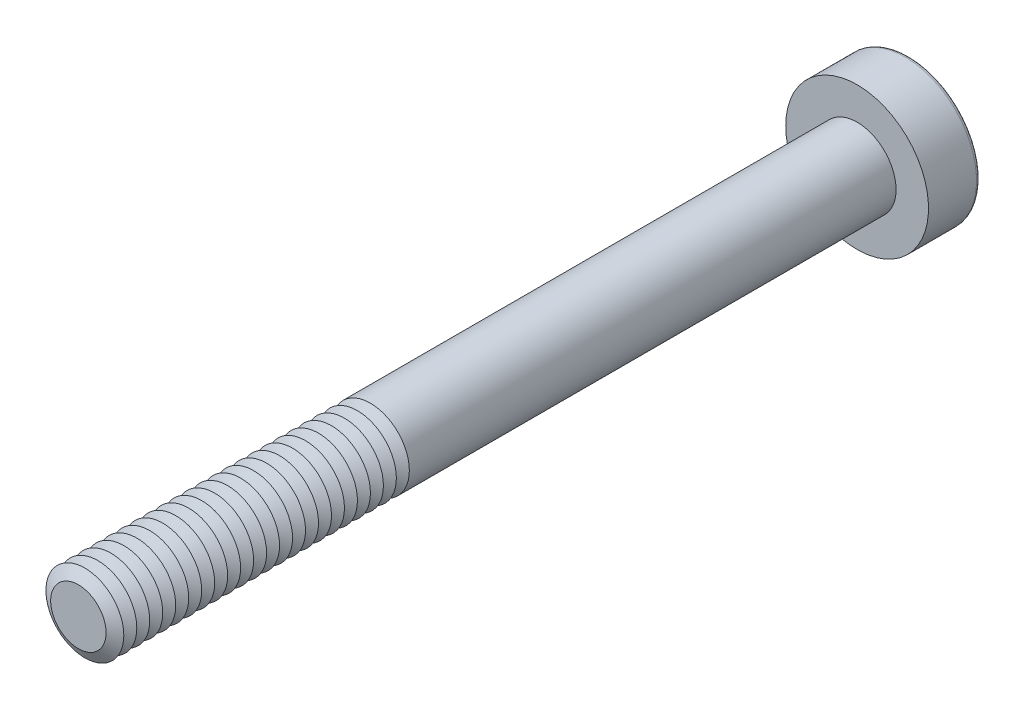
ISO-10303-21;
HEADER;
FILE_DESCRIPTION(('STEP AP214'),'2;1');
FILE_NAME('part.step','',(''),(''),'','','');
FILE_SCHEMA(('AUTOMOTIVE_DESIGN { 1 0 10303 214 1 1 1 1 }'));
ENDSEC;
DATA;
#1=APPLICATION_CONTEXT('core data for automotive mechanical design processes');
#2=APPLICATION_PROTOCOL_DEFINITION('international standard','automotive_design',2000,#1);
#3=PRODUCT_CONTEXT('',#1,'mechanical');
#4=PRODUCT('Part','Part','',(#3));
#5=PRODUCT_RELATED_PRODUCT_CATEGORY('part','',(#4));
#6=PRODUCT_DEFINITION_FORMATION('','',#4);
#7=PRODUCT_DEFINITION_CONTEXT('part definition',#1,'design');
#8=PRODUCT_DEFINITION('design','',#6,#7);
#9=PRODUCT_DEFINITION_SHAPE('','',#8);
#10=(LENGTH_UNIT() NAMED_UNIT(*) SI_UNIT(.MILLI.,.METRE.));
#11=(NAMED_UNIT(*) PLANE_ANGLE_UNIT() SI_UNIT($,.RADIAN.));
#12=(NAMED_UNIT(*) SI_UNIT($,.STERADIAN.) SOLID_ANGLE_UNIT());
#13=UNCERTAINTY_MEASURE_WITH_UNIT(LENGTH_MEASURE(1.E-05),#10,'distance_accuracy_value','');
#14=(GEOMETRIC_REPRESENTATION_CONTEXT(3) GLOBAL_UNCERTAINTY_ASSIGNED_CONTEXT((#13)) GLOBAL_UNIT_ASSIGNED_CONTEXT((#10,
#11,#12)) REPRESENTATION_CONTEXT('',''));
#15=CARTESIAN_POINT('',(0.,0.,0.));
#16=DIRECTION('',(0.,0.,1.));
#17=DIRECTION('',(1.,0.,0.));
#18=AXIS2_PLACEMENT_3D('',#15,#16,#17);
#19=CARTESIAN_POINT('',(0.,0.,28.25));
#20=DIRECTION('',(0.,0.,1.));
#21=DIRECTION('',(1.,0.,0.));
#22=AXIS2_PLACEMENT_3D('',#19,#20,#21);
#23=CONICAL_SURFACE('',#22,1.5,1.0471975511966);
#24=CARTESIAN_POINT('',(0.,0.,28.));
#25=DIRECTION('',(0.,0.,1.));
#26=DIRECTION('',(1.,0.,0.));
#27=AXIS2_PLACEMENT_3D('',#24,#25,#26);
#28=CIRCLE('',#27,1.06698729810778);
#29=CARTESIAN_POINT('',(1.06698729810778,0.,28.));
#30=VERTEX_POINT('',#29);
#31=EDGE_CURVE('E313',#30,#30,#28,.T.);
#32=ORIENTED_EDGE('',*,*,#31,.T.);
#33=EDGE_LOOP('',(#32));
#34=FACE_BOUND('',#33,.T.);
#35=CARTESIAN_POINT('',(0.,0.,28.25));
#36=DIRECTION('',(0.,0.,1.));
#37=DIRECTION('',(1.,0.,0.));
#38=AXIS2_PLACEMENT_3D('',#35,#36,#37);
#39=CIRCLE('',#38,1.5);
#40=CARTESIAN_POINT('',(1.5,0.,28.25));
#41=VERTEX_POINT('',#40);
#42=EDGE_CURVE('E316',#41,#41,#39,.T.);
#43=ORIENTED_EDGE('',*,*,#42,.F.);
#44=EDGE_LOOP('',(#43));
#45=FACE_BOUND('',#44,.T.);
#46=ADVANCED_FACE('F39',(#34,#45),#23,.T.);
#47=CARTESIAN_POINT('',(0.,0.,28.));
#48=DIRECTION('',(0.,0.,-1.));
#49=DIRECTION('',(-1.,0.,0.));
#50=AXIS2_PLACEMENT_3D('',#47,#48,#49);
#51=CONICAL_SURFACE('',#50,1.06698729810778,1.0471975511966);
#52=CARTESIAN_POINT('',(0.,0.,27.75));
#53=DIRECTION('',(0.,0.,1.));
#54=DIRECTION('',(1.,0.,0.));
#55=AXIS2_PLACEMENT_3D('',#52,#53,#54);
#56=CIRCLE('',#55,1.5);
#57=CARTESIAN_POINT('',(1.5,0.,27.75));
#58=VERTEX_POINT('',#57);
#59=EDGE_CURVE('E324',#58,#58,#56,.T.);
#60=ORIENTED_EDGE('',*,*,#59,.T.);
#61=EDGE_LOOP('',(#60));
#62=FACE_BOUND('',#61,.T.);
#63=ORIENTED_EDGE('',*,*,#31,.F.);
#64=EDGE_LOOP('',(#63));
#65=FACE_BOUND('',#64,.T.);
#66=ADVANCED_FACE('F245',(#62,#65),#51,.T.);
#67=CARTESIAN_POINT('',(0.,0.,30.));
#68=DIRECTION('',(0.,0.,1.));
#69=DIRECTION('',(1.,0.,0.));
#70=AXIS2_PLACEMENT_3D('',#67,#68,#69);
#71=PLANE('',#70);
#72=CARTESIAN_POINT('',(0.,0.,30.));
#73=DIRECTION('',(0.,0.,1.));
#74=DIRECTION('',(1.,0.,0.));
#75=AXIS2_PLACEMENT_3D('',#72,#73,#74);
#76=CIRCLE('',#75,1.06698729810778);
#77=CARTESIAN_POINT('',(1.06698729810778,0.,30.));
#78=VERTEX_POINT('',#77);
#79=EDGE_CURVE('E174',#78,#78,#76,.T.);
#80=ORIENTED_EDGE('',*,*,#79,.T.);
#81=EDGE_LOOP('',(#80));
#82=FACE_BOUND('',#81,.T.);
#83=ADVANCED_FACE('F251',(#82),#71,.T.);
#84=CARTESIAN_POINT('',(0.,0.,30.));
#85=DIRECTION('',(0.,0.,-1.));
#86=DIRECTION('',(-1.,0.,0.));
#87=AXIS2_PLACEMENT_3D('',#84,#85,#86);
#88=CONICAL_SURFACE('',#87,1.06698729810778,1.0471975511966);
#89=CARTESIAN_POINT('',(0.,0.,29.75));
#90=DIRECTION('',(0.,0.,1.));
#91=DIRECTION('',(1.,0.,0.));
#92=AXIS2_PLACEMENT_3D('',#89,#90,#91);
#93=CIRCLE('',#92,1.5);
#94=CARTESIAN_POINT('',(1.5,0.,29.75));
#95=VERTEX_POINT('',#94);
#96=EDGE_CURVE('E291',#95,#95,#93,.T.);
#97=ORIENTED_EDGE('',*,*,#96,.T.);
#98=EDGE_LOOP('',(#97));
#99=FACE_BOUND('',#98,.T.);
#100=ORIENTED_EDGE('',*,*,#79,.F.);
#101=EDGE_LOOP('',(#100));
#102=FACE_BOUND('',#101,.T.);
#103=ADVANCED_FACE('F199',(#99,#102),#88,.T.);
#104=CARTESIAN_POINT('',(0.,0.,29.75));
#105=DIRECTION('',(0.,0.,1.));
#106=DIRECTION('',(1.,0.,0.));
#107=AXIS2_PLACEMENT_3D('',#104,#105,#106);
#108=CONICAL_SURFACE('',#107,1.5,1.0471975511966);
#109=CARTESIAN_POINT('',(0.,0.,29.5));
#110=DIRECTION('',(0.,0.,1.));
#111=DIRECTION('',(1.,0.,0.));
#112=AXIS2_PLACEMENT_3D('',#109,#110,#111);
#113=CIRCLE('',#112,1.06698729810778);
#114=CARTESIAN_POINT('',(1.06698729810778,0.,29.5));
#115=VERTEX_POINT('',#114);
#116=EDGE_CURVE('E288',#115,#115,#113,.T.);
#117=ORIENTED_EDGE('',*,*,#116,.T.);
#118=EDGE_LOOP('',(#117));
#119=FACE_BOUND('',#118,.T.);
#120=ORIENTED_EDGE('',*,*,#96,.F.);
#121=EDGE_LOOP('',(#120));
#122=FACE_BOUND('',#121,.T.);
#123=ADVANCED_FACE('F277',(#119,#122),#108,.T.);
#124=CARTESIAN_POINT('',(0.,0.,29.5));
#125=DIRECTION('',(0.,0.,-1.));
#126=DIRECTION('',(-1.,0.,0.));
#127=AXIS2_PLACEMENT_3D('',#124,#125,#126);
#128=CONICAL_SURFACE('',#127,1.06698729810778,1.0471975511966);
#129=CARTESIAN_POINT('',(0.,0.,29.25));
#130=DIRECTION('',(0.,0.,1.));
#131=DIRECTION('',(1.,0.,0.));
#132=AXIS2_PLACEMENT_3D('',#129,#130,#131);
#133=CIRCLE('',#132,1.5);
#134=CARTESIAN_POINT('',(1.5,0.,29.25));
#135=VERTEX_POINT('',#134);
#136=EDGE_CURVE('E299',#135,#135,#133,.T.);
#137=ORIENTED_EDGE('',*,*,#136,.T.);
#138=EDGE_LOOP('',(#137));
#139=FACE_BOUND('',#138,.T.);
#140=ORIENTED_EDGE('',*,*,#116,.F.);
#141=EDGE_LOOP('',(#140));
#142=FACE_BOUND('',#141,.T.);
#143=ADVANCED_FACE('F274',(#139,#142),#128,.T.);
#144=CARTESIAN_POINT('',(0.,0.,29.25));
#145=DIRECTION('',(0.,0.,1.));
#146=DIRECTION('',(1.,0.,0.));
#147=AXIS2_PLACEMENT_3D('',#144,#145,#146);
#148=CONICAL_SURFACE('',#147,1.5,1.0471975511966);
#149=CARTESIAN_POINT('',(0.,0.,29.));
#150=DIRECTION('',(0.,0.,1.));
#151=DIRECTION('',(1.,0.,0.));
#152=AXIS2_PLACEMENT_3D('',#149,#150,#151);
#153=CIRCLE('',#152,1.06698729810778);
#154=CARTESIAN_POINT('',(1.06698729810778,0.,29.));
#155=VERTEX_POINT('',#154);
#156=EDGE_CURVE('E293',#155,#155,#153,.T.);
#157=ORIENTED_EDGE('',*,*,#156,.T.);
#158=EDGE_LOOP('',(#157));
#159=FACE_BOUND('',#158,.T.);
#160=ORIENTED_EDGE('',*,*,#136,.F.);
#161=EDGE_LOOP('',(#160));
#162=FACE_BOUND('',#161,.T.);
#163=ADVANCED_FACE('F270',(#159,#162),#148,.T.);
#164=CARTESIAN_POINT('',(0.,0.,29.));
#165=DIRECTION('',(0.,0.,-1.));
#166=DIRECTION('',(-1.,0.,0.));
#167=AXIS2_PLACEMENT_3D('',#164,#165,#166);
#168=CONICAL_SURFACE('',#167,1.06698729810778,1.0471975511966);
#169=CARTESIAN_POINT('',(0.,0.,28.75));
#170=DIRECTION('',(0.,0.,1.));
#171=DIRECTION('',(1.,0.,0.));
#172=AXIS2_PLACEMENT_3D('',#169,#170,#171);
#173=CIRCLE('',#172,1.5);
#174=CARTESIAN_POINT('',(1.5,0.,28.75));
#175=VERTEX_POINT('',#174);
#176=EDGE_CURVE('E309',#175,#175,#173,.T.);
#177=ORIENTED_EDGE('',*,*,#176,.T.);
#178=EDGE_LOOP('',(#177));
#179=FACE_BOUND('',#178,.T.);
#180=ORIENTED_EDGE('',*,*,#156,.F.);
#181=EDGE_LOOP('',(#180));
#182=FACE_BOUND('',#181,.T.);
#183=ADVANCED_FACE('F266',(#179,#182),#168,.T.);
#184=CARTESIAN_POINT('',(0.,0.,28.75));
#185=DIRECTION('',(0.,0.,1.));
#186=DIRECTION('',(1.,0.,0.));
#187=AXIS2_PLACEMENT_3D('',#184,#185,#186);
#188=CONICAL_SURFACE('',#187,1.5,1.0471975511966);
#189=CARTESIAN_POINT('',(0.,0.,28.5));
#190=DIRECTION('',(0.,0.,1.));
#191=DIRECTION('',(1.,0.,0.));
#192=AXIS2_PLACEMENT_3D('',#189,#190,#191);
#193=CIRCLE('',#192,1.06698729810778);
#194=CARTESIAN_POINT('',(1.06698729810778,0.,28.5));
#195=VERTEX_POINT('',#194);
#196=EDGE_CURVE('E305',#195,#195,#193,.T.);
#197=ORIENTED_EDGE('',*,*,#196,.T.);
#198=EDGE_LOOP('',(#197));
#199=FACE_BOUND('',#198,.T.);
#200=ORIENTED_EDGE('',*,*,#176,.F.);
#201=EDGE_LOOP('',(#200));
#202=FACE_BOUND('',#201,.T.);
#203=ADVANCED_FACE('F262',(#199,#202),#188,.T.);
#204=CARTESIAN_POINT('',(0.,0.,28.5));
#205=DIRECTION('',(0.,0.,-1.));
#206=DIRECTION('',(-1.,0.,0.));
#207=AXIS2_PLACEMENT_3D('',#204,#205,#206);
#208=CONICAL_SURFACE('',#207,1.06698729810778,1.0471975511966);
#209=ORIENTED_EDGE('',*,*,#42,.T.);
#210=EDGE_LOOP('',(#209));
#211=FACE_BOUND('',#210,.T.);
#212=ORIENTED_EDGE('',*,*,#196,.F.);
#213=EDGE_LOOP('',(#212));
#214=FACE_BOUND('',#213,.T.);
#215=ADVANCED_FACE('F258',(#211,#214),#208,.T.);
#216=CARTESIAN_POINT('',(0.,0.,27.75));
#217=DIRECTION('',(0.,0.,1.));
#218=DIRECTION('',(1.,0.,0.));
#219=AXIS2_PLACEMENT_3D('',#216,#217,#218);
#220=CONICAL_SURFACE('',#219,1.5,1.0471975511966);
#221=CARTESIAN_POINT('',(0.,0.,27.5));
#222=DIRECTION('',(0.,0.,1.));
#223=DIRECTION('',(1.,0.,0.));
#224=AXIS2_PLACEMENT_3D('',#221,#222,#223);
#225=CIRCLE('',#224,1.06698729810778);
#226=CARTESIAN_POINT('',(1.06698729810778,0.,27.5));
#227=VERTEX_POINT('',#226);
#228=EDGE_CURVE('E320',#227,#227,#225,.T.);
#229=ORIENTED_EDGE('',*,*,#228,.T.);
#230=EDGE_LOOP('',(#229));
#231=FACE_BOUND('',#230,.T.);
#232=ORIENTED_EDGE('',*,*,#59,.F.);
#233=EDGE_LOOP('',(#232));
#234=FACE_BOUND('',#233,.T.);
#235=ADVANCED_FACE('F261',(#231,#234),#220,.T.);
#236=CARTESIAN_POINT('',(0.,0.,27.5));
#237=DIRECTION('',(0.,0.,-1.));
#238=DIRECTION('',(-1.,0.,0.));
#239=AXIS2_PLACEMENT_3D('',#236,#237,#238);
#240=CONICAL_SURFACE('',#239,1.06698729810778,1.0471975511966);
#241=CARTESIAN_POINT('',(0.,0.,27.25));
#242=DIRECTION('',(0.,0.,1.));
#243=DIRECTION('',(1.,0.,0.));
#244=AXIS2_PLACEMENT_3D('',#241,#242,#243);
#245=CIRCLE('',#244,1.5);
#246=CARTESIAN_POINT('',(1.5,0.,27.25));
#247=VERTEX_POINT('',#246);
#248=EDGE_CURVE('E332',#247,#247,#245,.T.);
#249=ORIENTED_EDGE('',*,*,#248,.T.);
#250=EDGE_LOOP('',(#249));
#251=FACE_BOUND('',#250,.T.);
#252=ORIENTED_EDGE('',*,*,#228,.F.);
#253=EDGE_LOOP('',(#252));
#254=FACE_BOUND('',#253,.T.);
#255=ADVANCED_FACE('F606',(#251,#254),#240,.T.);
#256=CARTESIAN_POINT('',(0.,0.,27.25));
#257=DIRECTION('',(0.,0.,1.));
#258=DIRECTION('',(1.,0.,0.));
#259=AXIS2_PLACEMENT_3D('',#256,#257,#258);
#260=CONICAL_SURFACE('',#259,1.5,1.0471975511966);
#261=CARTESIAN_POINT('',(0.,0.,27.));
#262=DIRECTION('',(0.,0.,1.));
#263=DIRECTION('',(1.,0.,0.));
#264=AXIS2_PLACEMENT_3D('',#261,#262,#263);
#265=CIRCLE('',#264,1.06698729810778);
#266=CARTESIAN_POINT('',(1.06698729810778,0.,27.));
#267=VERTEX_POINT('',#266);
#268=EDGE_CURVE('E328',#267,#267,#265,.T.);
#269=ORIENTED_EDGE('',*,*,#268,.T.);
#270=EDGE_LOOP('',(#269));
#271=FACE_BOUND('',#270,.T.);
#272=ORIENTED_EDGE('',*,*,#248,.F.);
#273=EDGE_LOOP('',(#272));
#274=FACE_BOUND('',#273,.T.);
#275=ADVANCED_FACE('F602',(#271,#274),#260,.T.);
#276=CARTESIAN_POINT('',(0.,0.,27.));
#277=DIRECTION('',(0.,0.,-1.));
#278=DIRECTION('',(-1.,0.,0.));
#279=AXIS2_PLACEMENT_3D('',#276,#277,#278);
#280=CONICAL_SURFACE('',#279,1.06698729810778,1.0471975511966);
#281=CARTESIAN_POINT('',(0.,0.,26.75));
#282=DIRECTION('',(0.,0.,1.));
#283=DIRECTION('',(1.,0.,0.));
#284=AXIS2_PLACEMENT_3D('',#281,#282,#283);
#285=CIRCLE('',#284,1.5);
#286=CARTESIAN_POINT('',(1.5,0.,26.75));
#287=VERTEX_POINT('',#286);
#288=EDGE_CURVE('E340',#287,#287,#285,.T.);
#289=ORIENTED_EDGE('',*,*,#288,.T.);
#290=EDGE_LOOP('',(#289));
#291=FACE_BOUND('',#290,.T.);
#292=ORIENTED_EDGE('',*,*,#268,.F.);
#293=EDGE_LOOP('',(#292));
#294=FACE_BOUND('',#293,.T.);
#295=ADVANCED_FACE('F598',(#291,#294),#280,.T.);
#296=CARTESIAN_POINT('',(0.,0.,26.75));
#297=DIRECTION('',(0.,0.,1.));
#298=DIRECTION('',(1.,0.,0.));
#299=AXIS2_PLACEMENT_3D('',#296,#297,#298);
#300=CONICAL_SURFACE('',#299,1.5,1.0471975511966);
#301=CARTESIAN_POINT('',(0.,0.,26.5));
#302=DIRECTION('',(0.,0.,1.));
#303=DIRECTION('',(1.,0.,0.));
#304=AXIS2_PLACEMENT_3D('',#301,#302,#303);
#305=CIRCLE('',#304,1.06698729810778);
#306=CARTESIAN_POINT('',(1.06698729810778,0.,26.5));
#307=VERTEX_POINT('',#306);
#308=EDGE_CURVE('E336',#307,#307,#305,.T.);
#309=ORIENTED_EDGE('',*,*,#308,.T.);
#310=EDGE_LOOP('',(#309));
#311=FACE_BOUND('',#310,.T.);
#312=ORIENTED_EDGE('',*,*,#288,.F.);
#313=EDGE_LOOP('',(#312));
#314=FACE_BOUND('',#313,.T.);
#315=ADVANCED_FACE('F594',(#311,#314),#300,.T.);
#316=CARTESIAN_POINT('',(0.,0.,26.5));
#317=DIRECTION('',(0.,0.,-1.));
#318=DIRECTION('',(-1.,0.,0.));
#319=AXIS2_PLACEMENT_3D('',#316,#317,#318);
#320=CONICAL_SURFACE('',#319,1.06698729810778,1.0471975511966);
#321=CARTESIAN_POINT('',(0.,0.,26.25));
#322=DIRECTION('',(0.,0.,1.));
#323=DIRECTION('',(1.,0.,0.));
#324=AXIS2_PLACEMENT_3D('',#321,#322,#323);
#325=CIRCLE('',#324,1.5);
#326=CARTESIAN_POINT('',(1.5,0.,26.25));
#327=VERTEX_POINT('',#326);
#328=EDGE_CURVE('E348',#327,#327,#325,.T.);
#329=ORIENTED_EDGE('',*,*,#328,.T.);
#330=EDGE_LOOP('',(#329));
#331=FACE_BOUND('',#330,.T.);
#332=ORIENTED_EDGE('',*,*,#308,.F.);
#333=EDGE_LOOP('',(#332));
#334=FACE_BOUND('',#333,.T.);
#335=ADVANCED_FACE('F590',(#331,#334),#320,.T.);
#336=CARTESIAN_POINT('',(0.,0.,26.25));
#337=DIRECTION('',(0.,0.,1.));
#338=DIRECTION('',(1.,0.,0.));
#339=AXIS2_PLACEMENT_3D('',#336,#337,#338);
#340=CONICAL_SURFACE('',#339,1.5,1.0471975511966);
#341=CARTESIAN_POINT('',(0.,0.,26.));
#342=DIRECTION('',(0.,0.,1.));
#343=DIRECTION('',(1.,0.,0.));
#344=AXIS2_PLACEMENT_3D('',#341,#342,#343);
#345=CIRCLE('',#344,1.06698729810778);
#346=CARTESIAN_POINT('',(1.06698729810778,0.,26.));
#347=VERTEX_POINT('',#346);
#348=EDGE_CURVE('E344',#347,#347,#345,.T.);
#349=ORIENTED_EDGE('',*,*,#348,.T.);
#350=EDGE_LOOP('',(#349));
#351=FACE_BOUND('',#350,.T.);
#352=ORIENTED_EDGE('',*,*,#328,.F.);
#353=EDGE_LOOP('',(#352));
#354=FACE_BOUND('',#353,.T.);
#355=ADVANCED_FACE('F586',(#351,#354),#340,.T.);
#356=CARTESIAN_POINT('',(0.,0.,26.));
#357=DIRECTION('',(0.,0.,-1.));
#358=DIRECTION('',(-1.,0.,0.));
#359=AXIS2_PLACEMENT_3D('',#356,#357,#358);
#360=CONICAL_SURFACE('',#359,1.06698729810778,1.0471975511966);
#361=CARTESIAN_POINT('',(0.,0.,25.75));
#362=DIRECTION('',(0.,0.,1.));
#363=DIRECTION('',(1.,0.,0.));
#364=AXIS2_PLACEMENT_3D('',#361,#362,#363);
#365=CIRCLE('',#364,1.5);
#366=CARTESIAN_POINT('',(1.5,0.,25.75));
#367=VERTEX_POINT('',#366);
#368=EDGE_CURVE('E356',#367,#367,#365,.T.);
#369=ORIENTED_EDGE('',*,*,#368,.T.);
#370=EDGE_LOOP('',(#369));
#371=FACE_BOUND('',#370,.T.);
#372=ORIENTED_EDGE('',*,*,#348,.F.);
#373=EDGE_LOOP('',(#372));
#374=FACE_BOUND('',#373,.T.);
#375=ADVANCED_FACE('F582',(#371,#374),#360,.T.);
#376=CARTESIAN_POINT('',(0.,0.,25.75));
#377=DIRECTION('',(0.,0.,1.));
#378=DIRECTION('',(1.,0.,0.));
#379=AXIS2_PLACEMENT_3D('',#376,#377,#378);
#380=CONICAL_SURFACE('',#379,1.5,1.0471975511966);
#381=CARTESIAN_POINT('',(0.,0.,25.5));
#382=DIRECTION('',(0.,0.,1.));
#383=DIRECTION('',(1.,0.,0.));
#384=AXIS2_PLACEMENT_3D('',#381,#382,#383);
#385=CIRCLE('',#384,1.06698729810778);
#386=CARTESIAN_POINT('',(1.06698729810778,0.,25.5));
#387=VERTEX_POINT('',#386);
#388=EDGE_CURVE('E352',#387,#387,#385,.T.);
#389=ORIENTED_EDGE('',*,*,#388,.T.);
#390=EDGE_LOOP('',(#389));
#391=FACE_BOUND('',#390,.T.);
#392=ORIENTED_EDGE('',*,*,#368,.F.);
#393=EDGE_LOOP('',(#392));
#394=FACE_BOUND('',#393,.T.);
#395=ADVANCED_FACE('F578',(#391,#394),#380,.T.);
#396=CARTESIAN_POINT('',(0.,0.,25.5));
#397=DIRECTION('',(0.,0.,-1.));
#398=DIRECTION('',(-1.,0.,0.));
#399=AXIS2_PLACEMENT_3D('',#396,#397,#398);
#400=CONICAL_SURFACE('',#399,1.06698729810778,1.0471975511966);
#401=CARTESIAN_POINT('',(0.,0.,25.25));
#402=DIRECTION('',(0.,0.,1.));
#403=DIRECTION('',(1.,0.,0.));
#404=AXIS2_PLACEMENT_3D('',#401,#402,#403);
#405=CIRCLE('',#404,1.5);
#406=CARTESIAN_POINT('',(1.5,0.,25.25));
#407=VERTEX_POINT('',#406);
#408=EDGE_CURVE('E363',#407,#407,#405,.T.);
#409=ORIENTED_EDGE('',*,*,#408,.T.);
#410=EDGE_LOOP('',(#409));
#411=FACE_BOUND('',#410,.T.);
#412=ORIENTED_EDGE('',*,*,#388,.F.);
#413=EDGE_LOOP('',(#412));
#414=FACE_BOUND('',#413,.T.);
#415=ADVANCED_FACE('F574',(#411,#414),#400,.T.);
#416=CARTESIAN_POINT('',(0.,0.,25.25));
#417=DIRECTION('',(0.,0.,1.));
#418=DIRECTION('',(1.,0.,0.));
#419=AXIS2_PLACEMENT_3D('',#416,#417,#418);
#420=CONICAL_SURFACE('',#419,1.5,1.0471975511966);
#421=CARTESIAN_POINT('',(0.,0.,25.));
#422=DIRECTION('',(0.,0.,1.));
#423=DIRECTION('',(1.,0.,0.));
#424=AXIS2_PLACEMENT_3D('',#421,#422,#423);
#425=CIRCLE('',#424,1.06698729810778);
#426=CARTESIAN_POINT('',(1.06698729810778,0.,25.));
#427=VERTEX_POINT('',#426);
#428=EDGE_CURVE('E359',#427,#427,#425,.T.);
#429=ORIENTED_EDGE('',*,*,#428,.T.);
#430=EDGE_LOOP('',(#429));
#431=FACE_BOUND('',#430,.T.);
#432=ORIENTED_EDGE('',*,*,#408,.F.);
#433=EDGE_LOOP('',(#432));
#434=FACE_BOUND('',#433,.T.);
#435=ADVANCED_FACE('F570',(#431,#434),#420,.T.);
#436=CARTESIAN_POINT('',(0.,0.,25.));
#437=DIRECTION('',(0.,0.,-1.));
#438=DIRECTION('',(-1.,0.,0.));
#439=AXIS2_PLACEMENT_3D('',#436,#437,#438);
#440=CONICAL_SURFACE('',#439,1.06698729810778,1.0471975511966);
#441=CARTESIAN_POINT('',(0.,0.,24.75));
#442=DIRECTION('',(0.,0.,1.));
#443=DIRECTION('',(1.,0.,0.));
#444=AXIS2_PLACEMENT_3D('',#441,#442,#443);
#445=CIRCLE('',#444,1.5);
#446=CARTESIAN_POINT('',(1.5,0.,24.75));
#447=VERTEX_POINT('',#446);
#448=EDGE_CURVE('E371',#447,#447,#445,.T.);
#449=ORIENTED_EDGE('',*,*,#448,.T.);
#450=EDGE_LOOP('',(#449));
#451=FACE_BOUND('',#450,.T.);
#452=ORIENTED_EDGE('',*,*,#428,.F.);
#453=EDGE_LOOP('',(#452));
#454=FACE_BOUND('',#453,.T.);
#455=ADVANCED_FACE('F566',(#451,#454),#440,.T.);
#456=CARTESIAN_POINT('',(0.,0.,24.75));
#457=DIRECTION('',(0.,0.,1.));
#458=DIRECTION('',(1.,0.,0.));
#459=AXIS2_PLACEMENT_3D('',#456,#457,#458);
#460=CONICAL_SURFACE('',#459,1.5,1.0471975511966);
#461=CARTESIAN_POINT('',(0.,0.,24.5));
#462=DIRECTION('',(0.,0.,1.));
#463=DIRECTION('',(1.,0.,0.));
#464=AXIS2_PLACEMENT_3D('',#461,#462,#463);
#465=CIRCLE('',#464,1.06698729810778);
#466=CARTESIAN_POINT('',(1.06698729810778,0.,24.5));
#467=VERTEX_POINT('',#466);
#468=EDGE_CURVE('E367',#467,#467,#465,.T.);
#469=ORIENTED_EDGE('',*,*,#468,.T.);
#470=EDGE_LOOP('',(#469));
#471=FACE_BOUND('',#470,.T.);
#472=ORIENTED_EDGE('',*,*,#448,.F.);
#473=EDGE_LOOP('',(#472));
#474=FACE_BOUND('',#473,.T.);
#475=ADVANCED_FACE('F562',(#471,#474),#460,.T.);
#476=CARTESIAN_POINT('',(0.,0.,24.5));
#477=DIRECTION('',(0.,0.,-1.));
#478=DIRECTION('',(-1.,0.,0.));
#479=AXIS2_PLACEMENT_3D('',#476,#477,#478);
#480=CONICAL_SURFACE('',#479,1.06698729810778,1.0471975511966);
#481=CARTESIAN_POINT('',(0.,0.,24.25));
#482=DIRECTION('',(0.,0.,1.));
#483=DIRECTION('',(1.,0.,0.));
#484=AXIS2_PLACEMENT_3D('',#481,#482,#483);
#485=CIRCLE('',#484,1.5);
#486=CARTESIAN_POINT('',(1.5,0.,24.25));
#487=VERTEX_POINT('',#486);
#488=EDGE_CURVE('E379',#487,#487,#485,.T.);
#489=ORIENTED_EDGE('',*,*,#488,.T.);
#490=EDGE_LOOP('',(#489));
#491=FACE_BOUND('',#490,.T.);
#492=ORIENTED_EDGE('',*,*,#468,.F.);
#493=EDGE_LOOP('',(#492));
#494=FACE_BOUND('',#493,.T.);
#495=ADVANCED_FACE('F558',(#491,#494),#480,.T.);
#496=CARTESIAN_POINT('',(0.,0.,24.25));
#497=DIRECTION('',(0.,0.,1.));
#498=DIRECTION('',(1.,0.,0.));
#499=AXIS2_PLACEMENT_3D('',#496,#497,#498);
#500=CONICAL_SURFACE('',#499,1.5,1.0471975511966);
#501=CARTESIAN_POINT('',(0.,0.,24.));
#502=DIRECTION('',(0.,0.,1.));
#503=DIRECTION('',(1.,0.,0.));
#504=AXIS2_PLACEMENT_3D('',#501,#502,#503);
#505=CIRCLE('',#504,1.06698729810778);
#506=CARTESIAN_POINT('',(1.06698729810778,0.,24.));
#507=VERTEX_POINT('',#506);
#508=EDGE_CURVE('E375',#507,#507,#505,.T.);
#509=ORIENTED_EDGE('',*,*,#508,.T.);
#510=EDGE_LOOP('',(#509));
#511=FACE_BOUND('',#510,.T.);
#512=ORIENTED_EDGE('',*,*,#488,.F.);
#513=EDGE_LOOP('',(#512));
#514=FACE_BOUND('',#513,.T.);
#515=ADVANCED_FACE('F554',(#511,#514),#500,.T.);
#516=CARTESIAN_POINT('',(0.,0.,24.));
#517=DIRECTION('',(0.,0.,-1.));
#518=DIRECTION('',(-1.,0.,0.));
#519=AXIS2_PLACEMENT_3D('',#516,#517,#518);
#520=CONICAL_SURFACE('',#519,1.06698729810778,1.0471975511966);
#521=CARTESIAN_POINT('',(0.,0.,23.75));
#522=DIRECTION('',(0.,0.,1.));
#523=DIRECTION('',(1.,0.,0.));
#524=AXIS2_PLACEMENT_3D('',#521,#522,#523);
#525=CIRCLE('',#524,1.5);
#526=CARTESIAN_POINT('',(1.5,0.,23.75));
#527=VERTEX_POINT('',#526);
#528=EDGE_CURVE('E387',#527,#527,#525,.T.);
#529=ORIENTED_EDGE('',*,*,#528,.T.);
#530=EDGE_LOOP('',(#529));
#531=FACE_BOUND('',#530,.T.);
#532=ORIENTED_EDGE('',*,*,#508,.F.);
#533=EDGE_LOOP('',(#532));
#534=FACE_BOUND('',#533,.T.);
#535=ADVANCED_FACE('F550',(#531,#534),#520,.T.);
#536=CARTESIAN_POINT('',(0.,0.,23.75));
#537=DIRECTION('',(0.,0.,1.));
#538=DIRECTION('',(1.,0.,0.));
#539=AXIS2_PLACEMENT_3D('',#536,#537,#538);
#540=CONICAL_SURFACE('',#539,1.5,1.0471975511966);
#541=CARTESIAN_POINT('',(0.,0.,23.5));
#542=DIRECTION('',(0.,0.,1.));
#543=DIRECTION('',(1.,0.,0.));
#544=AXIS2_PLACEMENT_3D('',#541,#542,#543);
#545=CIRCLE('',#544,1.06698729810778);
#546=CARTESIAN_POINT('',(1.06698729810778,0.,23.5));
#547=VERTEX_POINT('',#546);
#548=EDGE_CURVE('E383',#547,#547,#545,.T.);
#549=ORIENTED_EDGE('',*,*,#548,.T.);
#550=EDGE_LOOP('',(#549));
#551=FACE_BOUND('',#550,.T.);
#552=ORIENTED_EDGE('',*,*,#528,.F.);
#553=EDGE_LOOP('',(#552));
#554=FACE_BOUND('',#553,.T.);
#555=ADVANCED_FACE('F546',(#551,#554),#540,.T.);
#556=CARTESIAN_POINT('',(0.,0.,23.5));
#557=DIRECTION('',(0.,0.,-1.));
#558=DIRECTION('',(-1.,0.,0.));
#559=AXIS2_PLACEMENT_3D('',#556,#557,#558);
#560=CONICAL_SURFACE('',#559,1.06698729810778,1.0471975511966);
#561=CARTESIAN_POINT('',(0.,0.,23.25));
#562=DIRECTION('',(0.,0.,1.));
#563=DIRECTION('',(1.,0.,0.));
#564=AXIS2_PLACEMENT_3D('',#561,#562,#563);
#565=CIRCLE('',#564,1.5);
#566=CARTESIAN_POINT('',(1.5,0.,23.25));
#567=VERTEX_POINT('',#566);
#568=EDGE_CURVE('E394',#567,#567,#565,.T.);
#569=ORIENTED_EDGE('',*,*,#568,.T.);
#570=EDGE_LOOP('',(#569));
#571=FACE_BOUND('',#570,.T.);
#572=ORIENTED_EDGE('',*,*,#548,.F.);
#573=EDGE_LOOP('',(#572));
#574=FACE_BOUND('',#573,.T.);
#575=ADVANCED_FACE('F542',(#571,#574),#560,.T.);
#576=CARTESIAN_POINT('',(0.,0.,23.25));
#577=DIRECTION('',(0.,0.,1.));
#578=DIRECTION('',(1.,0.,0.));
#579=AXIS2_PLACEMENT_3D('',#576,#577,#578);
#580=CONICAL_SURFACE('',#579,1.5,1.0471975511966);
#581=CARTESIAN_POINT('',(0.,0.,23.));
#582=DIRECTION('',(0.,0.,1.));
#583=DIRECTION('',(1.,0.,0.));
#584=AXIS2_PLACEMENT_3D('',#581,#582,#583);
#585=CIRCLE('',#584,1.06698729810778);
#586=CARTESIAN_POINT('',(1.06698729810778,0.,23.));
#587=VERTEX_POINT('',#586);
#588=EDGE_CURVE('E390',#587,#587,#585,.T.);
#589=ORIENTED_EDGE('',*,*,#588,.T.);
#590=EDGE_LOOP('',(#589));
#591=FACE_BOUND('',#590,.T.);
#592=ORIENTED_EDGE('',*,*,#568,.F.);
#593=EDGE_LOOP('',(#592));
#594=FACE_BOUND('',#593,.T.);
#595=ADVANCED_FACE('F538',(#591,#594),#580,.T.);
#596=CARTESIAN_POINT('',(0.,0.,23.));
#597=DIRECTION('',(0.,0.,-1.));
#598=DIRECTION('',(-1.,0.,0.));
#599=AXIS2_PLACEMENT_3D('',#596,#597,#598);
#600=CONICAL_SURFACE('',#599,1.06698729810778,1.0471975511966);
#601=CARTESIAN_POINT('',(0.,0.,22.75));
#602=DIRECTION('',(0.,0.,1.));
#603=DIRECTION('',(1.,0.,0.));
#604=AXIS2_PLACEMENT_3D('',#601,#602,#603);
#605=CIRCLE('',#604,1.5);
#606=CARTESIAN_POINT('',(1.5,0.,22.75));
#607=VERTEX_POINT('',#606);
#608=EDGE_CURVE('E401',#607,#607,#605,.T.);
#609=ORIENTED_EDGE('',*,*,#608,.T.);
#610=EDGE_LOOP('',(#609));
#611=FACE_BOUND('',#610,.T.);
#612=ORIENTED_EDGE('',*,*,#588,.F.);
#613=EDGE_LOOP('',(#612));
#614=FACE_BOUND('',#613,.T.);
#615=ADVANCED_FACE('F534',(#611,#614),#600,.T.);
#616=CARTESIAN_POINT('',(0.,0.,22.75));
#617=DIRECTION('',(0.,0.,1.));
#618=DIRECTION('',(1.,0.,0.));
#619=AXIS2_PLACEMENT_3D('',#616,#617,#618);
#620=CONICAL_SURFACE('',#619,1.5,1.0471975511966);
#621=CARTESIAN_POINT('',(0.,0.,22.5));
#622=DIRECTION('',(0.,0.,1.));
#623=DIRECTION('',(1.,0.,0.));
#624=AXIS2_PLACEMENT_3D('',#621,#622,#623);
#625=CIRCLE('',#624,1.06698729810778);
#626=CARTESIAN_POINT('',(1.06698729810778,0.,22.5));
#627=VERTEX_POINT('',#626);
#628=EDGE_CURVE('E398',#627,#627,#625,.T.);
#629=ORIENTED_EDGE('',*,*,#628,.T.);
#630=EDGE_LOOP('',(#629));
#631=FACE_BOUND('',#630,.T.);
#632=ORIENTED_EDGE('',*,*,#608,.F.);
#633=EDGE_LOOP('',(#632));
#634=FACE_BOUND('',#633,.T.);
#635=ADVANCED_FACE('F530',(#631,#634),#620,.T.);
#636=CARTESIAN_POINT('',(0.,0.,22.5));
#637=DIRECTION('',(0.,0.,-1.));
#638=DIRECTION('',(-1.,0.,0.));
#639=AXIS2_PLACEMENT_3D('',#636,#637,#638);
#640=CONICAL_SURFACE('',#639,1.06698729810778,1.0471975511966);
#641=CARTESIAN_POINT('',(0.,0.,22.25));
#642=DIRECTION('',(0.,0.,1.));
#643=DIRECTION('',(1.,0.,0.));
#644=AXIS2_PLACEMENT_3D('',#641,#642,#643);
#645=CIRCLE('',#644,1.5);
#646=CARTESIAN_POINT('',(1.5,0.,22.25));
#647=VERTEX_POINT('',#646);
#648=EDGE_CURVE('E409',#647,#647,#645,.T.);
#649=ORIENTED_EDGE('',*,*,#648,.T.);
#650=EDGE_LOOP('',(#649));
#651=FACE_BOUND('',#650,.T.);
#652=ORIENTED_EDGE('',*,*,#628,.F.);
#653=EDGE_LOOP('',(#652));
#654=FACE_BOUND('',#653,.T.);
#655=ADVANCED_FACE('F526',(#651,#654),#640,.T.);
#656=CARTESIAN_POINT('',(0.,0.,22.25));
#657=DIRECTION('',(0.,0.,1.));
#658=DIRECTION('',(1.,0.,0.));
#659=AXIS2_PLACEMENT_3D('',#656,#657,#658);
#660=CONICAL_SURFACE('',#659,1.5,1.0471975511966);
#661=CARTESIAN_POINT('',(0.,0.,22.));
#662=DIRECTION('',(0.,0.,1.));
#663=DIRECTION('',(1.,0.,0.));
#664=AXIS2_PLACEMENT_3D('',#661,#662,#663);
#665=CIRCLE('',#664,1.06698729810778);
#666=CARTESIAN_POINT('',(1.06698729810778,0.,22.));
#667=VERTEX_POINT('',#666);
#668=EDGE_CURVE('E405',#667,#667,#665,.T.);
#669=ORIENTED_EDGE('',*,*,#668,.T.);
#670=EDGE_LOOP('',(#669));
#671=FACE_BOUND('',#670,.T.);
#672=ORIENTED_EDGE('',*,*,#648,.F.);
#673=EDGE_LOOP('',(#672));
#674=FACE_BOUND('',#673,.T.);
#675=ADVANCED_FACE('F522',(#671,#674),#660,.T.);
#676=CARTESIAN_POINT('',(0.,0.,22.));
#677=DIRECTION('',(0.,0.,-1.));
#678=DIRECTION('',(-1.,0.,0.));
#679=AXIS2_PLACEMENT_3D('',#676,#677,#678);
#680=CONICAL_SURFACE('',#679,1.06698729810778,1.0471975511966);
#681=CARTESIAN_POINT('',(0.,0.,21.75));
#682=DIRECTION('',(0.,0.,1.));
#683=DIRECTION('',(1.,0.,0.));
#684=AXIS2_PLACEMENT_3D('',#681,#682,#683);
#685=CIRCLE('',#684,1.5);
#686=CARTESIAN_POINT('',(1.5,0.,21.75));
#687=VERTEX_POINT('',#686);
#688=EDGE_CURVE('E417',#687,#687,#685,.T.);
#689=ORIENTED_EDGE('',*,*,#688,.T.);
#690=EDGE_LOOP('',(#689));
#691=FACE_BOUND('',#690,.T.);
#692=ORIENTED_EDGE('',*,*,#668,.F.);
#693=EDGE_LOOP('',(#692));
#694=FACE_BOUND('',#693,.T.);
#695=ADVANCED_FACE('F518',(#691,#694),#680,.T.);
#696=CARTESIAN_POINT('',(0.,0.,21.75));
#697=DIRECTION('',(0.,0.,1.));
#698=DIRECTION('',(1.,0.,0.));
#699=AXIS2_PLACEMENT_3D('',#696,#697,#698);
#700=CONICAL_SURFACE('',#699,1.5,1.0471975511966);
#701=CARTESIAN_POINT('',(0.,0.,21.5));
#702=DIRECTION('',(0.,0.,1.));
#703=DIRECTION('',(1.,0.,0.));
#704=AXIS2_PLACEMENT_3D('',#701,#702,#703);
#705=CIRCLE('',#704,1.06698729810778);
#706=CARTESIAN_POINT('',(1.06698729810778,0.,21.5));
#707=VERTEX_POINT('',#706);
#708=EDGE_CURVE('E413',#707,#707,#705,.T.);
#709=ORIENTED_EDGE('',*,*,#708,.T.);
#710=EDGE_LOOP('',(#709));
#711=FACE_BOUND('',#710,.T.);
#712=ORIENTED_EDGE('',*,*,#688,.F.);
#713=EDGE_LOOP('',(#712));
#714=FACE_BOUND('',#713,.T.);
#715=ADVANCED_FACE('F514',(#711,#714),#700,.T.);
#716=CARTESIAN_POINT('',(0.,0.,21.5));
#717=DIRECTION('',(0.,0.,-1.));
#718=DIRECTION('',(-1.,0.,0.));
#719=AXIS2_PLACEMENT_3D('',#716,#717,#718);
#720=CONICAL_SURFACE('',#719,1.06698729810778,1.0471975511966);
#721=CARTESIAN_POINT('',(0.,0.,21.25));
#722=DIRECTION('',(0.,0.,1.));
#723=DIRECTION('',(1.,0.,0.));
#724=AXIS2_PLACEMENT_3D('',#721,#722,#723);
#725=CIRCLE('',#724,1.5);
#726=CARTESIAN_POINT('',(1.5,0.,21.25));
#727=VERTEX_POINT('',#726);
#728=EDGE_CURVE('E425',#727,#727,#725,.T.);
#729=ORIENTED_EDGE('',*,*,#728,.T.);
#730=EDGE_LOOP('',(#729));
#731=FACE_BOUND('',#730,.T.);
#732=ORIENTED_EDGE('',*,*,#708,.F.);
#733=EDGE_LOOP('',(#732));
#734=FACE_BOUND('',#733,.T.);
#735=ADVANCED_FACE('F510',(#731,#734),#720,.T.);
#736=CARTESIAN_POINT('',(0.,0.,21.25));
#737=DIRECTION('',(0.,0.,1.));
#738=DIRECTION('',(1.,0.,0.));
#739=AXIS2_PLACEMENT_3D('',#736,#737,#738);
#740=CONICAL_SURFACE('',#739,1.5,1.0471975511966);
#741=CARTESIAN_POINT('',(0.,0.,21.));
#742=DIRECTION('',(0.,0.,1.));
#743=DIRECTION('',(1.,0.,0.));
#744=AXIS2_PLACEMENT_3D('',#741,#742,#743);
#745=CIRCLE('',#744,1.06698729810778);
#746=CARTESIAN_POINT('',(1.06698729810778,0.,21.));
#747=VERTEX_POINT('',#746);
#748=EDGE_CURVE('E421',#747,#747,#745,.T.);
#749=ORIENTED_EDGE('',*,*,#748,.T.);
#750=EDGE_LOOP('',(#749));
#751=FACE_BOUND('',#750,.T.);
#752=ORIENTED_EDGE('',*,*,#728,.F.);
#753=EDGE_LOOP('',(#752));
#754=FACE_BOUND('',#753,.T.);
#755=ADVANCED_FACE('F506',(#751,#754),#740,.T.);
#756=CARTESIAN_POINT('',(0.,0.,21.));
#757=DIRECTION('',(0.,0.,-1.));
#758=DIRECTION('',(-1.,0.,0.));
#759=AXIS2_PLACEMENT_3D('',#756,#757,#758);
#760=CONICAL_SURFACE('',#759,1.06698729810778,1.0471975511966);
#761=CARTESIAN_POINT('',(0.,0.,20.75));
#762=DIRECTION('',(0.,0.,1.));
#763=DIRECTION('',(1.,0.,0.));
#764=AXIS2_PLACEMENT_3D('',#761,#762,#763);
#765=CIRCLE('',#764,1.5);
#766=CARTESIAN_POINT('',(1.5,0.,20.75));
#767=VERTEX_POINT('',#766);
#768=EDGE_CURVE('E433',#767,#767,#765,.T.);
#769=ORIENTED_EDGE('',*,*,#768,.T.);
#770=EDGE_LOOP('',(#769));
#771=FACE_BOUND('',#770,.T.);
#772=ORIENTED_EDGE('',*,*,#748,.F.);
#773=EDGE_LOOP('',(#772));
#774=FACE_BOUND('',#773,.T.);
#775=ADVANCED_FACE('F502',(#771,#774),#760,.T.);
#776=CARTESIAN_POINT('',(0.,0.,20.75));
#777=DIRECTION('',(0.,0.,1.));
#778=DIRECTION('',(1.,0.,0.));
#779=AXIS2_PLACEMENT_3D('',#776,#777,#778);
#780=CONICAL_SURFACE('',#779,1.5,1.0471975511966);
#781=CARTESIAN_POINT('',(0.,0.,20.5));
#782=DIRECTION('',(0.,0.,1.));
#783=DIRECTION('',(1.,0.,0.));
#784=AXIS2_PLACEMENT_3D('',#781,#782,#783);
#785=CIRCLE('',#784,1.06698729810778);
#786=CARTESIAN_POINT('',(1.06698729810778,0.,20.5));
#787=VERTEX_POINT('',#786);
#788=EDGE_CURVE('E429',#787,#787,#785,.T.);
#789=ORIENTED_EDGE('',*,*,#788,.T.);
#790=EDGE_LOOP('',(#789));
#791=FACE_BOUND('',#790,.T.);
#792=ORIENTED_EDGE('',*,*,#768,.F.);
#793=EDGE_LOOP('',(#792));
#794=FACE_BOUND('',#793,.T.);
#795=ADVANCED_FACE('F498',(#791,#794),#780,.T.);
#796=CARTESIAN_POINT('',(0.,0.,20.5));
#797=DIRECTION('',(0.,0.,-1.));
#798=DIRECTION('',(-1.,0.,0.));
#799=AXIS2_PLACEMENT_3D('',#796,#797,#798);
#800=CONICAL_SURFACE('',#799,1.06698729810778,1.0471975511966);
#801=CARTESIAN_POINT('',(0.,0.,20.25));
#802=DIRECTION('',(0.,0.,1.));
#803=DIRECTION('',(1.,0.,0.));
#804=AXIS2_PLACEMENT_3D('',#801,#802,#803);
#805=CIRCLE('',#804,1.5);
#806=CARTESIAN_POINT('',(1.5,0.,20.25));
#807=VERTEX_POINT('',#806);
#808=EDGE_CURVE('E441',#807,#807,#805,.T.);
#809=ORIENTED_EDGE('',*,*,#808,.T.);
#810=EDGE_LOOP('',(#809));
#811=FACE_BOUND('',#810,.T.);
#812=ORIENTED_EDGE('',*,*,#788,.F.);
#813=EDGE_LOOP('',(#812));
#814=FACE_BOUND('',#813,.T.);
#815=ADVANCED_FACE('F494',(#811,#814),#800,.T.);
#816=CARTESIAN_POINT('',(0.,0.,20.25));
#817=DIRECTION('',(0.,0.,1.));
#818=DIRECTION('',(1.,0.,0.));
#819=AXIS2_PLACEMENT_3D('',#816,#817,#818);
#820=CONICAL_SURFACE('',#819,1.5,1.0471975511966);
#821=CARTESIAN_POINT('',(0.,0.,20.));
#822=DIRECTION('',(0.,0.,1.));
#823=DIRECTION('',(1.,0.,0.));
#824=AXIS2_PLACEMENT_3D('',#821,#822,#823);
#825=CIRCLE('',#824,1.06698729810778);
#826=CARTESIAN_POINT('',(1.06698729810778,0.,20.));
#827=VERTEX_POINT('',#826);
#828=EDGE_CURVE('E437',#827,#827,#825,.T.);
#829=ORIENTED_EDGE('',*,*,#828,.T.);
#830=EDGE_LOOP('',(#829));
#831=FACE_BOUND('',#830,.T.);
#832=ORIENTED_EDGE('',*,*,#808,.F.);
#833=EDGE_LOOP('',(#832));
#834=FACE_BOUND('',#833,.T.);
#835=ADVANCED_FACE('F490',(#831,#834),#820,.T.);
#836=CARTESIAN_POINT('',(0.,0.,20.));
#837=DIRECTION('',(0.,0.,-1.));
#838=DIRECTION('',(-1.,0.,0.));
#839=AXIS2_PLACEMENT_3D('',#836,#837,#838);
#840=CONICAL_SURFACE('',#839,1.06698729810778,1.0471975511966);
#841=CARTESIAN_POINT('',(0.,0.,19.75));
#842=DIRECTION('',(0.,0.,1.));
#843=DIRECTION('',(1.,0.,0.));
#844=AXIS2_PLACEMENT_3D('',#841,#842,#843);
#845=CIRCLE('',#844,1.5);
#846=CARTESIAN_POINT('',(1.5,0.,19.75));
#847=VERTEX_POINT('',#846);
#848=EDGE_CURVE('E449',#847,#847,#845,.T.);
#849=ORIENTED_EDGE('',*,*,#848,.T.);
#850=EDGE_LOOP('',(#849));
#851=FACE_BOUND('',#850,.T.);
#852=ORIENTED_EDGE('',*,*,#828,.F.);
#853=EDGE_LOOP('',(#852));
#854=FACE_BOUND('',#853,.T.);
#855=ADVANCED_FACE('F486',(#851,#854),#840,.T.);
#856=CARTESIAN_POINT('',(0.,0.,19.75));
#857=DIRECTION('',(0.,0.,1.));
#858=DIRECTION('',(1.,0.,0.));
#859=AXIS2_PLACEMENT_3D('',#856,#857,#858);
#860=CONICAL_SURFACE('',#859,1.5,1.0471975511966);
#861=CARTESIAN_POINT('',(0.,0.,19.5));
#862=DIRECTION('',(0.,0.,1.));
#863=DIRECTION('',(1.,0.,0.));
#864=AXIS2_PLACEMENT_3D('',#861,#862,#863);
#865=CIRCLE('',#864,1.06698729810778);
#866=CARTESIAN_POINT('',(1.06698729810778,0.,19.5));
#867=VERTEX_POINT('',#866);
#868=EDGE_CURVE('E445',#867,#867,#865,.T.);
#869=ORIENTED_EDGE('',*,*,#868,.T.);
#870=EDGE_LOOP('',(#869));
#871=FACE_BOUND('',#870,.T.);
#872=ORIENTED_EDGE('',*,*,#848,.F.);
#873=EDGE_LOOP('',(#872));
#874=FACE_BOUND('',#873,.T.);
#875=ADVANCED_FACE('F481',(#871,#874),#860,.T.);
#876=CARTESIAN_POINT('',(0.,0.,19.5));
#877=DIRECTION('',(0.,0.,-1.));
#878=DIRECTION('',(-1.,0.,0.));
#879=AXIS2_PLACEMENT_3D('',#876,#877,#878);
#880=CONICAL_SURFACE('',#879,1.06698729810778,1.0471975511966);
#881=CARTESIAN_POINT('',(0.,0.,19.25));
#882=DIRECTION('',(0.,0.,1.));
#883=DIRECTION('',(1.,0.,0.));
#884=AXIS2_PLACEMENT_3D('',#881,#882,#883);
#885=CIRCLE('',#884,1.5);
#886=CARTESIAN_POINT('',(1.5,0.,19.25));
#887=VERTEX_POINT('',#886);
#888=EDGE_CURVE('E461',#887,#887,#885,.T.);
#889=ORIENTED_EDGE('',*,*,#888,.T.);
#890=EDGE_LOOP('',(#889));
#891=FACE_BOUND('',#890,.T.);
#892=ORIENTED_EDGE('',*,*,#868,.F.);
#893=EDGE_LOOP('',(#892));
#894=FACE_BOUND('',#893,.T.);
#895=ADVANCED_FACE('F467',(#891,#894),#880,.T.);
#896=CARTESIAN_POINT('',(0.,0.,19.25));
#897=DIRECTION('',(0.,0.,1.));
#898=DIRECTION('',(1.,0.,0.));
#899=AXIS2_PLACEMENT_3D('',#896,#897,#898);
#900=CONICAL_SURFACE('',#899,1.5,1.0471975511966);
#901=CARTESIAN_POINT('',(0.,0.,19.));
#902=DIRECTION('',(0.,0.,1.));
#903=DIRECTION('',(1.,0.,0.));
#904=AXIS2_PLACEMENT_3D('',#901,#902,#903);
#905=CIRCLE('',#904,1.06698729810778);
#906=CARTESIAN_POINT('',(1.06698729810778,0.,19.));
#907=VERTEX_POINT('',#906);
#908=EDGE_CURVE('E453',#907,#907,#905,.T.);
#909=ORIENTED_EDGE('',*,*,#908,.T.);
#910=EDGE_LOOP('',(#909));
#911=FACE_BOUND('',#910,.T.);
#912=ORIENTED_EDGE('',*,*,#888,.F.);
#913=EDGE_LOOP('',(#912));
#914=FACE_BOUND('',#913,.T.);
#915=ADVANCED_FACE('F470',(#911,#914),#900,.T.);
#916=CARTESIAN_POINT('',(0.,0.,19.));
#917=DIRECTION('',(0.,0.,-1.));
#918=DIRECTION('',(-1.,0.,0.));
#919=AXIS2_PLACEMENT_3D('',#916,#917,#918);
#920=CONICAL_SURFACE('',#919,1.06698729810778,1.0471975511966);
#921=CARTESIAN_POINT('',(0.,0.,18.75));
#922=DIRECTION('',(0.,0.,1.));
#923=DIRECTION('',(1.,0.,0.));
#924=AXIS2_PLACEMENT_3D('',#921,#922,#923);
#925=CIRCLE('',#924,1.5);
#926=CARTESIAN_POINT('',(1.5,0.,18.75));
#927=VERTEX_POINT('',#926);
#928=EDGE_CURVE('E457',#927,#927,#925,.T.);
#929=ORIENTED_EDGE('',*,*,#928,.T.);
#930=EDGE_LOOP('',(#929));
#931=FACE_BOUND('',#930,.T.);
#932=ORIENTED_EDGE('',*,*,#908,.F.);
#933=EDGE_LOOP('',(#932));
#934=FACE_BOUND('',#933,.T.);
#935=ADVANCED_FACE('F472',(#931,#934),#920,.T.);
#936=CARTESIAN_POINT('',(0.,0.,-0.5));
#937=DIRECTION('',(0.,0.,-1.));
#938=DIRECTION('',(-1.,0.,0.));
#939=AXIS2_PLACEMENT_3D('',#936,#937,#938);
#940=CONICAL_SURFACE('',#939,0.999999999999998,1.0471975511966);
#941=CARTESIAN_POINT('',(0.,0.,0.0773502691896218));
#942=VERTEX_POINT('',#941);
#943=VERTEX_LOOP('',#942);
#944=FACE_BOUND('',#943,.T.);
#945=CARTESIAN_POINT('',(0.,0.,-0.5));
#946=DIRECTION('',(0.,0.,-1.));
#947=DIRECTION('',(-1.,0.,0.));
#948=AXIS2_PLACEMENT_3D('',#945,#946,#947);
#949=CIRCLE('',#948,0.999999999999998);
#950=CARTESIAN_POINT('',(-0.866025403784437,0.499999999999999,-0.5));
#951=VERTEX_POINT('',#950);
#952=CARTESIAN_POINT('',(0.,0.999999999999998,-0.5));
#953=VERTEX_POINT('',#952);
#954=EDGE_CURVE('E149',#951,#953,#949,.T.);
#955=ORIENTED_EDGE('',*,*,#954,.T.);
#956=CARTESIAN_POINT('',(0.,0.,-0.5));
#957=DIRECTION('',(0.,0.,-1.));
#958=DIRECTION('',(-1.,0.,0.));
#959=AXIS2_PLACEMENT_3D('',#956,#957,#958);
#960=CIRCLE('',#959,0.999999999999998);
#961=CARTESIAN_POINT('',(0.866025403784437,0.499999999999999,-0.5));
#962=VERTEX_POINT('',#961);
#963=EDGE_CURVE('E54',#953,#962,#960,.T.);
#964=ORIENTED_EDGE('',*,*,#963,.T.);
#965=CARTESIAN_POINT('',(0.866025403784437,-0.499999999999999,-0.5));
#966=VERTEX_POINT('',#965);
#967=EDGE_CURVE('E1205',#962,#966,#960,.T.);
#968=ORIENTED_EDGE('',*,*,#967,.T.);
#969=CARTESIAN_POINT('',(0.,-0.999999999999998,-0.5));
#970=VERTEX_POINT('',#969);
#971=EDGE_CURVE('E1204',#966,#970,#960,.T.);
#972=ORIENTED_EDGE('',*,*,#971,.T.);
#973=CARTESIAN_POINT('',(-0.866025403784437,-0.499999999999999,-0.5));
#974=VERTEX_POINT('',#973);
#975=EDGE_CURVE('E1198',#970,#974,#960,.T.);
#976=ORIENTED_EDGE('',*,*,#975,.T.);
#977=EDGE_CURVE('E1196',#974,#951,#960,.T.);
#978=ORIENTED_EDGE('',*,*,#977,.T.);
#979=EDGE_LOOP('',(#955,#964,#968,#972,#976,#978));
#980=FACE_BOUND('',#979,.T.);
#981=ADVANCED_FACE('F201',(#944,#980),#940,.F.);
#982=CARTESIAN_POINT('',(0.,0.,-0.5));
#983=DIRECTION('',(0.,0.,-1.));
#984=DIRECTION('',(-1.,0.,0.));
#985=AXIS2_PLACEMENT_3D('',#982,#983,#984);
#986=PLANE('',#985);
#987=ORIENTED_EDGE('',*,*,#963,.F.);
#988=DIRECTION('',(1.,0.,0.));
#989=VECTOR('',#988,1.);
#990=CARTESIAN_POINT('',(-0.577350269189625,1.,-0.5));
#991=LINE('',#990,#989);
#992=CARTESIAN_POINT('',(0.577350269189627,1.,-0.5));
#993=VERTEX_POINT('',#992);
#994=EDGE_CURVE('E1246',#953,#993,#991,.T.);
#995=ORIENTED_EDGE('',*,*,#994,.T.);
#996=DIRECTION('',(0.5,-0.866025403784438,0.));
#997=VECTOR('',#996,1.);
#998=CARTESIAN_POINT('',(0.577350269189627,1.,-0.5));
#999=LINE('',#998,#997);
#1000=EDGE_CURVE('E155',#993,#962,#999,.T.);
#1001=ORIENTED_EDGE('',*,*,#1000,.T.);
#1002=EDGE_LOOP('',(#987,#995,#1001));
#1003=FACE_BOUND('',#1002,.T.);
#1004=ADVANCED_FACE('F737',(#1003),#986,.T.);
#1005=ORIENTED_EDGE('',*,*,#967,.F.);
#1006=CARTESIAN_POINT('',(1.15470053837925,0.,-0.5));
#1007=VERTEX_POINT('',#1006);
#1008=EDGE_CURVE('E1249',#962,#1007,#999,.T.);
#1009=ORIENTED_EDGE('',*,*,#1008,.T.);
#1010=DIRECTION('',(-0.5,-0.866025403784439,0.));
#1011=VECTOR('',#1010,1.);
#1012=CARTESIAN_POINT('',(1.15470053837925,0.,-0.5));
#1013=LINE('',#1012,#1011);
#1014=EDGE_CURVE('E1219',#1007,#966,#1013,.T.);
#1015=ORIENTED_EDGE('',*,*,#1014,.T.);
#1016=EDGE_LOOP('',(#1005,#1009,#1015));
#1017=FACE_BOUND('',#1016,.T.);
#1018=ADVANCED_FACE('F747',(#1017),#986,.T.);
#1019=ORIENTED_EDGE('',*,*,#971,.F.);
#1020=CARTESIAN_POINT('',(0.577350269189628,-1.,-0.5));
#1021=VERTEX_POINT('',#1020);
#1022=EDGE_CURVE('E1221',#966,#1021,#1013,.T.);
#1023=ORIENTED_EDGE('',*,*,#1022,.T.);
#1024=DIRECTION('',(-1.,0.,0.));
#1025=VECTOR('',#1024,1.);
#1026=CARTESIAN_POINT('',(0.577350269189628,-1.,-0.5));
#1027=LINE('',#1026,#1025);
#1028=EDGE_CURVE('E1171',#1021,#970,#1027,.T.);
#1029=ORIENTED_EDGE('',*,*,#1028,.T.);
#1030=EDGE_LOOP('',(#1019,#1023,#1029));
#1031=FACE_BOUND('',#1030,.T.);
#1032=ADVANCED_FACE('F757',(#1031),#986,.T.);
#1033=ORIENTED_EDGE('',*,*,#975,.F.);
#1034=CARTESIAN_POINT('',(-0.577350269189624,-0.999999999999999,-0.5));
#1035=VERTEX_POINT('',#1034);
#1036=EDGE_CURVE('E1215',#970,#1035,#1027,.T.);
#1037=ORIENTED_EDGE('',*,*,#1036,.T.);
#1038=DIRECTION('',(-0.5,0.866025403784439,0.));
#1039=VECTOR('',#1038,1.);
#1040=CARTESIAN_POINT('',(-0.577350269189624,-0.999999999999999,-0.5));
#1041=LINE('',#1040,#1039);
#1042=EDGE_CURVE('E1217',#1035,#974,#1041,.T.);
#1043=ORIENTED_EDGE('',*,*,#1042,.T.);
#1044=EDGE_LOOP('',(#1033,#1037,#1043));
#1045=FACE_BOUND('',#1044,.T.);
#1046=ADVANCED_FACE('F765',(#1045),#986,.T.);
#1047=ORIENTED_EDGE('',*,*,#977,.F.);
#1048=CARTESIAN_POINT('',(-1.15470053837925,0.,-0.5));
#1049=VERTEX_POINT('',#1048);
#1050=EDGE_CURVE('E1223',#974,#1049,#1041,.T.);
#1051=ORIENTED_EDGE('',*,*,#1050,.T.);
#1052=DIRECTION('',(0.5,0.866025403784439,0.));
#1053=VECTOR('',#1052,1.);
#1054=CARTESIAN_POINT('',(-1.15470053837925,0.,-0.5));
#1055=LINE('',#1054,#1053);
#1056=EDGE_CURVE('E158',#1049,#951,#1055,.T.);
#1057=ORIENTED_EDGE('',*,*,#1056,.T.);
#1058=EDGE_LOOP('',(#1047,#1051,#1057));
#1059=FACE_BOUND('',#1058,.T.);
#1060=ADVANCED_FACE('F231',(#1059),#986,.T.);
#1061=ORIENTED_EDGE('',*,*,#954,.F.);
#1062=CARTESIAN_POINT('',(-0.577350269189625,1.,-0.5));
#1063=VERTEX_POINT('',#1062);
#1064=EDGE_CURVE('E1229',#951,#1063,#1055,.T.);
#1065=ORIENTED_EDGE('',*,*,#1064,.T.);
#1066=EDGE_CURVE('E1244',#1063,#953,#991,.T.);
#1067=ORIENTED_EDGE('',*,*,#1066,.T.);
#1068=EDGE_LOOP('',(#1061,#1065,#1067));
#1069=FACE_BOUND('',#1068,.T.);
#1070=ADVANCED_FACE('F749',(#1069),#986,.T.);
#1071=CARTESIAN_POINT('',(-0.577350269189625,1.,-0.5));
#1072=DIRECTION('',(0.,1.,0.));
#1073=DIRECTION('',(0.,0.,1.));
#1074=AXIS2_PLACEMENT_3D('',#1071,#1072,#1073);
#1075=PLANE('',#1074);
#1076=DIRECTION('',(0.,0.,-1.));
#1077=VECTOR('',#1076,1.);
#1078=CARTESIAN_POINT('',(-0.577350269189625,1.,-0.5));
#1079=LINE('',#1078,#1077);
#1080=CARTESIAN_POINT('',(-0.577350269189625,1.,-2.));
#1081=VERTEX_POINT('',#1080);
#1082=EDGE_CURVE('E147',#1063,#1081,#1079,.T.);
#1083=ORIENTED_EDGE('',*,*,#1082,.T.);
#1084=CARTESIAN_POINT('',(-1.50720379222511,1.,-2.17525844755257));
#1085=CARTESIAN_POINT('',(-1.46204888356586,1.,-2.16517814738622));
#1086=CARTESIAN_POINT('',(-1.41686530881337,1.,-2.15522625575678));
#1087=CARTESIAN_POINT('',(-1.32642642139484,1.,-2.13564428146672));
#1088=CARTESIAN_POINT('',(-1.28117110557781,1.,-2.12601421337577));
#1089=CARTESIAN_POINT('',(-1.14519006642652,1.,-2.09768643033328));
#1090=CARTESIAN_POINT('',(-1.05434091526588,1.,-2.07957187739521));
#1091=CARTESIAN_POINT('',(-0.87298578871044,1.,-2.04585879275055));
#1092=CARTESIAN_POINT('',(-0.782483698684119,1.,-2.03023975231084));
#1093=CARTESIAN_POINT('',(-0.600935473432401,1.,-2.00256781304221));
#1094=CARTESIAN_POINT('',(-0.509889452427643,1.,-1.99051419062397));
#1095=CARTESIAN_POINT('',(-0.326198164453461,1.,-1.9715245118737));
#1096=CARTESIAN_POINT('',(-0.233546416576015,1.,-1.96464740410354));
#1097=CARTESIAN_POINT('',(-0.0480110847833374,1.,-1.95773316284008));
#1098=CARTESIAN_POINT('',(0.0448723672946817,1.,-1.95769276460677));
#1099=CARTESIAN_POINT('',(0.230753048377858,1.,-1.96446847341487));
#1100=CARTESIAN_POINT('',(0.323749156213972,1.,-1.97131296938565));
#1101=CARTESIAN_POINT('',(0.509217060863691,1.,-1.99040362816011));
#1102=CARTESIAN_POINT('',(0.601688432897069,1.,-2.00265366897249));
#1103=CARTESIAN_POINT('',(0.788469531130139,1.,-2.0311825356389));
#1104=CARTESIAN_POINT('',(0.882763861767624,1.,-2.04755860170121));
#1105=CARTESIAN_POINT('',(1.07089474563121,1.,-2.08278522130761));
#1106=CARTESIAN_POINT('',(1.16473122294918,1.,-2.1016361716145));
#1107=CARTESIAN_POINT('',(1.35209202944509,1.,-2.14094224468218));
#1108=CARTESIAN_POINT('',(1.44561626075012,1.,-2.16139782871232));
#1109=CARTESIAN_POINT('',(1.63242626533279,1.,-2.20337233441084));
#1110=CARTESIAN_POINT('',(1.72571203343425,1.,-2.22489127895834));
#1111=CARTESIAN_POINT('',(1.91097396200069,1.,-2.26839206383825));
#1112=CARTESIAN_POINT('',(2.00295221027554,1.,-2.29036504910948));
#1113=CARTESIAN_POINT('',(2.18678775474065,1.,-2.3348190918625));
#1114=CARTESIAN_POINT('',(2.27864504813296,1.,-2.35730016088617));
#1115=CARTESIAN_POINT('',(2.46214009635,1.,-2.40260092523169));
#1116=CARTESIAN_POINT('',(2.55377797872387,1.,-2.42542010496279));
#1117=CARTESIAN_POINT('',(2.73697957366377,1.,-2.47134052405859));
#1118=CARTESIAN_POINT('',(2.82854328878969,1.,-2.49444175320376));
#1119=CARTESIAN_POINT('',(2.92008180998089,1.,-2.51764127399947));
#1120=B_SPLINE_CURVE_WITH_KNOTS('',3,(#1084,#1085,#1086,#1087,#1088,#1089,#1090,#1091,#1092,
#1093,#1094,#1095,#1096,#1097,#1098,#1099,#1100,#1101,#1102,#1103,#1104,#1105,#1106,#1107,#1108,
#1109,#1110,#1111,#1112,#1113,#1114,#1115,#1116,#1117,#1118,#1119),.UNSPECIFIED.,.F.,.F.,(4,2,2,
2,2,2,2,2,2,2,2,2,2,2,2,2,2,4),(0.,0.138798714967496,0.277603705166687,0.555495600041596,
0.830971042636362,1.106390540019,1.38490086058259,1.66327818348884,1.94280808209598,
2.22253884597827,2.50960639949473,2.79672003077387,3.08391650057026,3.37111915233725,
3.65481652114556,3.93852034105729,4.22182877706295,4.50512697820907),.UNSPECIFIED.);
#1121=CARTESIAN_POINT('',(0.577350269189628,0.999999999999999,-2.));
#1122=VERTEX_POINT('',#1121);
#1123=EDGE_CURVE('E124',#1081,#1122,#1120,.T.);
#1124=ORIENTED_EDGE('',*,*,#1123,.T.);
#1125=DIRECTION('',(0.,0.,-1.));
#1126=VECTOR('',#1125,1.);
#1127=CARTESIAN_POINT('',(0.577350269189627,1.,-0.5));
#1128=LINE('',#1127,#1126);
#1129=EDGE_CURVE('E143',#993,#1122,#1128,.T.);
#1130=ORIENTED_EDGE('',*,*,#1129,.F.);
#1131=ORIENTED_EDGE('',*,*,#994,.F.);
#1132=ORIENTED_EDGE('',*,*,#1066,.F.);
#1133=EDGE_LOOP('',(#1083,#1124,#1130,#1131,#1132));
#1134=FACE_BOUND('',#1133,.T.);
#1135=ADVANCED_FACE('F141',(#1134),#1075,.F.);
#1136=CARTESIAN_POINT('',(0.577350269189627,1.,-0.5));
#1137=DIRECTION('',(0.866025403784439,0.5,0.));
#1138=DIRECTION('',(-0.5,0.866025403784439,0.));
#1139=AXIS2_PLACEMENT_3D('',#1136,#1137,#1138);
#1140=PLANE('',#1139);
#1141=ORIENTED_EDGE('',*,*,#1129,.T.);
#1142=CARTESIAN_POINT('',(0.577234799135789,1.0002,-2.00003094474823));
#1143=CARTESIAN_POINT('',(0.601220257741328,0.958655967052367,-1.99359970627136));
#1144=CARTESIAN_POINT('',(0.625249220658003,0.917036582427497,-1.98776108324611));
#1145=CARTESIAN_POINT('',(0.673392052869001,0.833650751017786,-1.97750302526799));
#1146=CARTESIAN_POINT('',(0.697505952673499,0.79188425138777,-1.97308416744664));
#1147=CARTESIAN_POINT('',(0.745672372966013,0.70845756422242,-1.96592373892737));
#1148=CARTESIAN_POINT('',(0.769724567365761,0.666797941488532,-1.96317362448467));
#1149=CARTESIAN_POINT('',(0.817859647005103,0.583425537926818,-1.95948598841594));
#1150=CARTESIAN_POINT('',(0.841942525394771,0.541712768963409,-1.95854811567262));
#1151=CARTESIAN_POINT('',(0.890108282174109,0.458287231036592,-1.95854811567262));
#1152=CARTESIAN_POINT('',(0.914191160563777,0.416574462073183,-1.95948598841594));
#1153=CARTESIAN_POINT('',(0.962326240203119,0.33320205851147,-1.96317362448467));
#1154=CARTESIAN_POINT('',(0.986378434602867,0.291542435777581,-1.96592373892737));
#1155=CARTESIAN_POINT('',(1.03454485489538,0.208115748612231,-1.97308416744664));
#1156=CARTESIAN_POINT('',(1.05865875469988,0.166349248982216,-1.97750302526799));
#1157=CARTESIAN_POINT('',(1.10680158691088,0.0829634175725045,-1.98776108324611));
#1158=CARTESIAN_POINT('',(1.13083054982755,0.0413440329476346,-1.99359970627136));
#1159=CARTESIAN_POINT('',(1.15481600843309,-0.000199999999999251,-2.00003094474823));
#1160=B_SPLINE_CURVE_WITH_KNOTS('',3,(#1142,#1143,#1144,#1145,#1146,#1147,#1148,#1149,#1150,
#1151,#1152,#1153,#1154,#1155,#1156,#1157,#1158,#1159),.UNSPECIFIED.,.F.,.F.,(4,2,2,2,2,2,2,2,
4),(0.,0.145207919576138,0.290474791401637,0.434991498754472,0.579480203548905,
0.723968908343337,0.868485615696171,1.01375248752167,1.15896040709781),.UNSPECIFIED.);
#1161=CARTESIAN_POINT('',(1.15470053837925,0.,-2.));
#1162=VERTEX_POINT('',#1161);
#1163=EDGE_CURVE('E11',#1122,#1162,#1160,.T.);
#1164=ORIENTED_EDGE('',*,*,#1163,.T.);
#1165=DIRECTION('',(0.,0.,-1.));
#1166=VECTOR('',#1165,1.);
#1167=CARTESIAN_POINT('',(1.15470053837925,0.,-0.5));
#1168=LINE('',#1167,#1166);
#1169=EDGE_CURVE('E157',#1007,#1162,#1168,.T.);
#1170=ORIENTED_EDGE('',*,*,#1169,.F.);
#1171=ORIENTED_EDGE('',*,*,#1008,.F.);
#1172=ORIENTED_EDGE('',*,*,#1000,.F.);
#1173=EDGE_LOOP('',(#1141,#1164,#1170,#1171,#1172));
#1174=FACE_BOUND('',#1173,.T.);
#1175=ADVANCED_FACE('F152',(#1174),#1140,.F.);
#1176=CARTESIAN_POINT('',(1.15470053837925,0.,-0.5));
#1177=DIRECTION('',(0.866025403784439,-0.5,0.));
#1178=DIRECTION('',(0.5,0.866025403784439,0.));
#1179=AXIS2_PLACEMENT_3D('',#1176,#1177,#1178);
#1180=PLANE('',#1179);
#1181=ORIENTED_EDGE('',*,*,#1169,.T.);
#1182=CARTESIAN_POINT('',(1.15481600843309,0.000200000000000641,-2.00003094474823));
#1183=CARTESIAN_POINT('',(1.13083054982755,-0.0413440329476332,-1.99359970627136));
#1184=CARTESIAN_POINT('',(1.10680158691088,-0.0829634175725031,-1.98776108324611));
#1185=CARTESIAN_POINT('',(1.05865875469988,-0.166349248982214,-1.97750302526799));
#1186=CARTESIAN_POINT('',(1.03454485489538,-0.20811574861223,-1.97308416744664));
#1187=CARTESIAN_POINT('',(0.986378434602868,-0.29154243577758,-1.96592373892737));
#1188=CARTESIAN_POINT('',(0.962326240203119,-0.333202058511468,-1.96317362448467));
#1189=CARTESIAN_POINT('',(0.914191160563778,-0.416574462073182,-1.95948598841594));
#1190=CARTESIAN_POINT('',(0.890108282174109,-0.458287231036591,-1.95854811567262));
#1191=CARTESIAN_POINT('',(0.841942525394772,-0.541712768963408,-1.95854811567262));
#1192=CARTESIAN_POINT('',(0.817859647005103,-0.583425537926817,-1.95948598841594));
#1193=CARTESIAN_POINT('',(0.769724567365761,-0.66679794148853,-1.96317362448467));
#1194=CARTESIAN_POINT('',(0.745672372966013,-0.708457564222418,-1.96592373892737));
#1195=CARTESIAN_POINT('',(0.6975059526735,-0.791884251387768,-1.97308416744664));
#1196=CARTESIAN_POINT('',(0.673392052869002,-0.833650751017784,-1.97750302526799));
#1197=CARTESIAN_POINT('',(0.625249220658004,-0.917036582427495,-1.98776108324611));
#1198=CARTESIAN_POINT('',(0.601220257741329,-0.958655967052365,-1.99359970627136));
#1199=CARTESIAN_POINT('',(0.57723479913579,-1.0002,-2.00003094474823));
#1200=B_SPLINE_CURVE_WITH_KNOTS('',3,(#1182,#1183,#1184,#1185,#1186,#1187,#1188,#1189,#1190,
#1191,#1192,#1193,#1194,#1195,#1196,#1197,#1198,#1199),.UNSPECIFIED.,.F.,.F.,(4,2,2,2,2,2,2,2,
4),(0.,0.145207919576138,0.290474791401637,0.434991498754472,0.579480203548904,
0.723968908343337,0.868485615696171,1.01375248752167,1.15896040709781),.UNSPECIFIED.);
#1201=CARTESIAN_POINT('',(0.577350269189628,-0.999999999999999,-2.));
#1202=VERTEX_POINT('',#1201);
#1203=EDGE_CURVE('E173',#1162,#1202,#1200,.T.);
#1204=ORIENTED_EDGE('',*,*,#1203,.T.);
#1205=DIRECTION('',(0.,0.,-1.));
#1206=VECTOR('',#1205,1.);
#1207=CARTESIAN_POINT('',(0.577350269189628,-1.,-0.5));
#1208=LINE('',#1207,#1206);
#1209=EDGE_CURVE('E1166',#1021,#1202,#1208,.T.);
#1210=ORIENTED_EDGE('',*,*,#1209,.F.);
#1211=ORIENTED_EDGE('',*,*,#1022,.F.);
#1212=ORIENTED_EDGE('',*,*,#1014,.F.);
#1213=EDGE_LOOP('',(#1181,#1204,#1210,#1211,#1212));
#1214=FACE_BOUND('',#1213,.T.);
#1215=ADVANCED_FACE('F191',(#1214),#1180,.F.);
#1216=CARTESIAN_POINT('',(0.577350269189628,-1.,-0.5));
#1217=DIRECTION('',(0.,-1.,0.));
#1218=DIRECTION('',(1.,0.,0.));
#1219=AXIS2_PLACEMENT_3D('',#1216,#1217,#1218);
#1220=PLANE('',#1219);
#1221=ORIENTED_EDGE('',*,*,#1209,.T.);
#1222=CARTESIAN_POINT('',(-1.50720379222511,-0.999999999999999,-2.17525844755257));
#1223=CARTESIAN_POINT('',(-1.46204888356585,-0.999999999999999,-2.16517814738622));
#1224=CARTESIAN_POINT('',(-1.41686530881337,-0.999999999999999,-2.15522625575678));
#1225=CARTESIAN_POINT('',(-1.32642642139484,-0.999999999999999,-2.13564428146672));
#1226=CARTESIAN_POINT('',(-1.28117110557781,-0.999999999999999,-2.12601421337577));
#1227=CARTESIAN_POINT('',(-1.14519006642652,-0.999999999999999,-2.09768643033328));
#1228=CARTESIAN_POINT('',(-1.05434091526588,-0.999999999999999,-2.07957187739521));
#1229=CARTESIAN_POINT('',(-0.87298578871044,-0.999999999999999,-2.04585879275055));
#1230=CARTESIAN_POINT('',(-0.782483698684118,-0.999999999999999,-2.03023975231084));
#1231=CARTESIAN_POINT('',(-0.600935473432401,-0.999999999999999,-2.00256781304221));
#1232=CARTESIAN_POINT('',(-0.509889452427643,-0.999999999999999,-1.99051419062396));
#1233=CARTESIAN_POINT('',(-0.326198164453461,-0.999999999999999,-1.9715245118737));
#1234=CARTESIAN_POINT('',(-0.233546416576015,-0.999999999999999,-1.96464740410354));
#1235=CARTESIAN_POINT('',(-0.0480110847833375,-0.999999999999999,-1.95773316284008));
#1236=CARTESIAN_POINT('',(0.0448723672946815,-0.999999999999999,-1.95769276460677));
#1237=CARTESIAN_POINT('',(0.230753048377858,-0.999999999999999,-1.96446847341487));
#1238=CARTESIAN_POINT('',(0.323749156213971,-1.,-1.97131296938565));
#1239=CARTESIAN_POINT('',(0.50921706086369,-1.,-1.99040362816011));
#1240=CARTESIAN_POINT('',(0.601688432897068,-1.,-2.00265366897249));
#1241=CARTESIAN_POINT('',(0.788469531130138,-1.,-2.0311825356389));
#1242=CARTESIAN_POINT('',(0.882763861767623,-1.,-2.04755860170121));
#1243=CARTESIAN_POINT('',(1.07089474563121,-1.,-2.08278522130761));
#1244=CARTESIAN_POINT('',(1.16473122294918,-1.,-2.1016361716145));
#1245=CARTESIAN_POINT('',(1.35209202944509,-1.,-2.14094224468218));
#1246=CARTESIAN_POINT('',(1.44561626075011,-1.,-2.16139782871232));
#1247=CARTESIAN_POINT('',(1.63242626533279,-1.,-2.20337233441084));
#1248=CARTESIAN_POINT('',(1.72571203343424,-1.,-2.22489127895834));
#1249=CARTESIAN_POINT('',(1.91097396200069,-1.,-2.26839206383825));
#1250=CARTESIAN_POINT('',(2.00295221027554,-1.,-2.29036504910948));
#1251=CARTESIAN_POINT('',(2.18678775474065,-1.,-2.3348190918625));
#1252=CARTESIAN_POINT('',(2.27864504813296,-1.,-2.35730016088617));
#1253=CARTESIAN_POINT('',(2.46214009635,-1.,-2.40260092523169));
#1254=CARTESIAN_POINT('',(2.55377797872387,-1.,-2.42542010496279));
#1255=CARTESIAN_POINT('',(2.73697957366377,-1.,-2.47134052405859));
#1256=CARTESIAN_POINT('',(2.82854328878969,-1.,-2.49444175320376));
#1257=CARTESIAN_POINT('',(2.92008180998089,-1.,-2.51764127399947));
#1258=B_SPLINE_CURVE_WITH_KNOTS('',3,(#1222,#1223,#1224,#1225,#1226,#1227,#1228,#1229,#1230,
#1231,#1232,#1233,#1234,#1235,#1236,#1237,#1238,#1239,#1240,#1241,#1242,#1243,#1244,#1245,#1246,
#1247,#1248,#1249,#1250,#1251,#1252,#1253,#1254,#1255,#1256,#1257),.UNSPECIFIED.,.F.,.F.,(4,2,2,
2,2,2,2,2,2,2,2,2,2,2,2,2,2,4),(0.,0.138798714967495,0.277603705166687,0.555495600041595,
0.83097104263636,1.106390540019,1.38490086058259,1.66327818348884,1.94280808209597,
2.22253884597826,2.50960639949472,2.79672003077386,3.08391650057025,3.37111915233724,
3.65481652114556,3.93852034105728,4.22182877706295,4.50512697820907),.UNSPECIFIED.);
#1259=CARTESIAN_POINT('',(-0.577350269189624,-0.999999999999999,-2.));
#1260=VERTEX_POINT('',#1259);
#1261=EDGE_CURVE('E184',#1202,#1260,#1258,.F.);
#1262=ORIENTED_EDGE('',*,*,#1261,.T.);
#1263=DIRECTION('',(0.,0.,-1.));
#1264=VECTOR('',#1263,1.);
#1265=CARTESIAN_POINT('',(-0.577350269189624,-0.999999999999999,-0.5));
#1266=LINE('',#1265,#1264);
#1267=EDGE_CURVE('E1173',#1035,#1260,#1266,.T.);
#1268=ORIENTED_EDGE('',*,*,#1267,.F.);
#1269=ORIENTED_EDGE('',*,*,#1036,.F.);
#1270=ORIENTED_EDGE('',*,*,#1028,.F.);
#1271=EDGE_LOOP('',(#1221,#1262,#1268,#1269,#1270));
#1272=FACE_BOUND('',#1271,.T.);
#1273=ADVANCED_FACE('F234',(#1272),#1220,.F.);
#1274=CARTESIAN_POINT('',(-0.577350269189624,-0.999999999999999,-0.5));
#1275=DIRECTION('',(-0.866025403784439,-0.5,0.));
#1276=DIRECTION('',(0.5,-0.866025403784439,0.));
#1277=AXIS2_PLACEMENT_3D('',#1274,#1275,#1276);
#1278=PLANE('',#1277);
#1279=ORIENTED_EDGE('',*,*,#1267,.T.);
#1280=CARTESIAN_POINT('',(-0.577234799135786,-1.0002,-2.00003094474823));
#1281=CARTESIAN_POINT('',(-0.601220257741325,-0.958655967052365,-1.99359970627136));
#1282=CARTESIAN_POINT('',(-0.625249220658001,-0.917036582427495,-1.98776108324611));
#1283=CARTESIAN_POINT('',(-0.673392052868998,-0.833650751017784,-1.97750302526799));
#1284=CARTESIAN_POINT('',(-0.697505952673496,-0.791884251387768,-1.97308416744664));
#1285=CARTESIAN_POINT('',(-0.74567237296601,-0.708457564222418,-1.96592373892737));
#1286=CARTESIAN_POINT('',(-0.769724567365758,-0.66679794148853,-1.96317362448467));
#1287=CARTESIAN_POINT('',(-0.8178596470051,-0.583425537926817,-1.95948598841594));
#1288=CARTESIAN_POINT('',(-0.841942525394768,-0.541712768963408,-1.95854811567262));
#1289=CARTESIAN_POINT('',(-0.890108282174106,-0.45828723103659,-1.95854811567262));
#1290=CARTESIAN_POINT('',(-0.914191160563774,-0.416574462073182,-1.95948598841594));
#1291=CARTESIAN_POINT('',(-0.962326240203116,-0.333202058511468,-1.96317362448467));
#1292=CARTESIAN_POINT('',(-0.986378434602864,-0.29154243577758,-1.96592373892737));
#1293=CARTESIAN_POINT('',(-1.03454485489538,-0.20811574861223,-1.97308416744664));
#1294=CARTESIAN_POINT('',(-1.05865875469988,-0.166349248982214,-1.97750302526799));
#1295=CARTESIAN_POINT('',(-1.10680158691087,-0.0829634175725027,-1.98776108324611));
#1296=CARTESIAN_POINT('',(-1.13083054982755,-0.0413440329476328,-1.99359970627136));
#1297=CARTESIAN_POINT('',(-1.15481600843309,0.000200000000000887,-2.00003094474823));
#1298=B_SPLINE_CURVE_WITH_KNOTS('',3,(#1280,#1281,#1282,#1283,#1284,#1285,#1286,#1287,#1288,
#1289,#1290,#1291,#1292,#1293,#1294,#1295,#1296,#1297),.UNSPECIFIED.,.F.,.F.,(4,2,2,2,2,2,2,2,
4),(0.,0.145207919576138,0.290474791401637,0.434991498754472,0.579480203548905,
0.723968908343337,0.868485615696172,1.01375248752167,1.15896040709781),.UNSPECIFIED.);
#1299=CARTESIAN_POINT('',(-1.15470053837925,0.,-2.));
#1300=VERTEX_POINT('',#1299);
#1301=EDGE_CURVE('E208',#1260,#1300,#1298,.T.);
#1302=ORIENTED_EDGE('',*,*,#1301,.T.);
#1303=DIRECTION('',(0.,0.,-1.));
#1304=VECTOR('',#1303,1.);
#1305=CARTESIAN_POINT('',(-1.15470053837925,0.,-0.5));
#1306=LINE('',#1305,#1304);
#1307=EDGE_CURVE('E1176',#1049,#1300,#1306,.T.);
#1308=ORIENTED_EDGE('',*,*,#1307,.F.);
#1309=ORIENTED_EDGE('',*,*,#1050,.F.);
#1310=ORIENTED_EDGE('',*,*,#1042,.F.);
#1311=EDGE_LOOP('',(#1279,#1302,#1308,#1309,#1310));
#1312=FACE_BOUND('',#1311,.T.);
#1313=ADVANCED_FACE('F229',(#1312),#1278,.F.);
#1314=CARTESIAN_POINT('',(-1.15470053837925,0.,-0.5));
#1315=DIRECTION('',(-0.866025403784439,0.5,0.));
#1316=DIRECTION('',(-0.5,-0.866025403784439,0.));
#1317=AXIS2_PLACEMENT_3D('',#1314,#1315,#1316);
#1318=PLANE('',#1317);
#1319=ORIENTED_EDGE('',*,*,#1307,.T.);
#1320=CARTESIAN_POINT('',(-1.15481600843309,-0.000199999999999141,-2.00003094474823));
#1321=CARTESIAN_POINT('',(-1.13083054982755,0.0413440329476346,-1.99359970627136));
#1322=CARTESIAN_POINT('',(-1.10680158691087,0.0829634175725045,-1.98776108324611));
#1323=CARTESIAN_POINT('',(-1.05865875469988,0.166349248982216,-1.97750302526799));
#1324=CARTESIAN_POINT('',(-1.03454485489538,0.208115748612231,-1.97308416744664));
#1325=CARTESIAN_POINT('',(-0.986378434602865,0.291542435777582,-1.96592373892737));
#1326=CARTESIAN_POINT('',(-0.962326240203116,0.333202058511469,-1.96317362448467));
#1327=CARTESIAN_POINT('',(-0.914191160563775,0.416574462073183,-1.95948598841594));
#1328=CARTESIAN_POINT('',(-0.890108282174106,0.458287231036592,-1.95854811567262));
#1329=CARTESIAN_POINT('',(-0.841942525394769,0.541712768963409,-1.95854811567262));
#1330=CARTESIAN_POINT('',(-0.8178596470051,0.583425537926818,-1.95948598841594));
#1331=CARTESIAN_POINT('',(-0.769724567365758,0.666797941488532,-1.96317362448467));
#1332=CARTESIAN_POINT('',(-0.74567237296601,0.70845756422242,-1.96592373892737));
#1333=CARTESIAN_POINT('',(-0.697505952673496,0.79188425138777,-1.97308416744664));
#1334=CARTESIAN_POINT('',(-0.673392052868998,0.833650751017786,-1.97750302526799));
#1335=CARTESIAN_POINT('',(-0.625249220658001,0.917036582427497,-1.98776108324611));
#1336=CARTESIAN_POINT('',(-0.601220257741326,0.958655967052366,-1.99359970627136));
#1337=CARTESIAN_POINT('',(-0.577234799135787,1.0002,-2.00003094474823));
#1338=B_SPLINE_CURVE_WITH_KNOTS('',3,(#1320,#1321,#1322,#1323,#1324,#1325,#1326,#1327,#1328,
#1329,#1330,#1331,#1332,#1333,#1334,#1335,#1336,#1337),.UNSPECIFIED.,.F.,.F.,(4,2,2,2,2,2,2,2,
4),(0.,0.145207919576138,0.290474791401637,0.434991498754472,0.579480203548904,
0.723968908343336,0.868485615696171,1.01375248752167,1.15896040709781),.UNSPECIFIED.);
#1339=EDGE_CURVE('E150',#1300,#1081,#1338,.T.);
#1340=ORIENTED_EDGE('',*,*,#1339,.T.);
#1341=ORIENTED_EDGE('',*,*,#1082,.F.);
#1342=ORIENTED_EDGE('',*,*,#1064,.F.);
#1343=ORIENTED_EDGE('',*,*,#1056,.F.);
#1344=EDGE_LOOP('',(#1319,#1340,#1341,#1342,#1343));
#1345=FACE_BOUND('',#1344,.T.);
#1346=ADVANCED_FACE('F197',(#1345),#1318,.F.);
#1347=CARTESIAN_POINT('',(0.,0.,-2.));
#1348=DIRECTION('',(0.,0.,-1.));
#1349=DIRECTION('',(-1.,0.,0.));
#1350=AXIS2_PLACEMENT_3D('',#1347,#1348,#1349);
#1351=CONICAL_SURFACE('',#1350,1.15470053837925,1.30899693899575);
#1352=CARTESIAN_POINT('',(0.,0.,-2.));
#1353=DIRECTION('',(0.,0.,-1.));
#1354=DIRECTION('',(-1.,0.,0.));
#1355=AXIS2_PLACEMENT_3D('',#1352,#1353,#1354);
#1356=CIRCLE('',#1355,1.15470053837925);
#1357=EDGE_CURVE('E120',#1081,#1122,#1356,.T.);
#1358=ORIENTED_EDGE('',*,*,#1357,.T.);
#1359=ORIENTED_EDGE('',*,*,#1123,.F.);
#1360=EDGE_LOOP('',(#1358,#1359));
#1361=FACE_BOUND('',#1360,.T.);
#1362=ADVANCED_FACE('F122',(#1361),#1351,.F.);
#1363=EDGE_CURVE('E129',#1122,#1162,#1356,.T.);
#1364=ORIENTED_EDGE('',*,*,#1363,.T.);
#1365=ORIENTED_EDGE('',*,*,#1163,.F.);
#1366=EDGE_LOOP('',(#1364,#1365));
#1367=FACE_BOUND('',#1366,.T.);
#1368=ADVANCED_FACE('F133',(#1367),#1351,.F.);
#1369=EDGE_CURVE('E164',#1162,#1202,#1356,.T.);
#1370=ORIENTED_EDGE('',*,*,#1369,.T.);
#1371=ORIENTED_EDGE('',*,*,#1203,.F.);
#1372=EDGE_LOOP('',(#1370,#1371));
#1373=FACE_BOUND('',#1372,.T.);
#1374=ADVANCED_FACE('F830',(#1373),#1351,.F.);
#1375=EDGE_CURVE('E169',#1202,#1260,#1356,.T.);
#1376=ORIENTED_EDGE('',*,*,#1375,.T.);
#1377=ORIENTED_EDGE('',*,*,#1261,.F.);
#1378=EDGE_LOOP('',(#1376,#1377));
#1379=FACE_BOUND('',#1378,.T.);
#1380=ADVANCED_FACE('F837',(#1379),#1351,.F.);
#1381=EDGE_CURVE('E67',#1260,#1300,#1356,.T.);
#1382=ORIENTED_EDGE('',*,*,#1381,.T.);
#1383=ORIENTED_EDGE('',*,*,#1301,.F.);
#1384=EDGE_LOOP('',(#1382,#1383));
#1385=FACE_BOUND('',#1384,.T.);
#1386=ADVANCED_FACE('F845',(#1385),#1351,.F.);
#1387=EDGE_CURVE('E60',#1300,#1081,#1356,.T.);
#1388=ORIENTED_EDGE('',*,*,#1387,.T.);
#1389=ORIENTED_EDGE('',*,*,#1339,.F.);
#1390=EDGE_LOOP('',(#1388,#1389));
#1391=FACE_BOUND('',#1390,.T.);
#1392=ADVANCED_FACE('F198',(#1391),#1351,.F.);
#1393=CARTESIAN_POINT('',(0.,0.,-2.));
#1394=DIRECTION('',(0.,0.,-1.));
#1395=DIRECTION('',(-1.,0.,0.));
#1396=AXIS2_PLACEMENT_3D('',#1393,#1394,#1395);
#1397=PLANE('',#1396);
#1398=ORIENTED_EDGE('',*,*,#1387,.F.);
#1399=ORIENTED_EDGE('',*,*,#1381,.F.);
#1400=ORIENTED_EDGE('',*,*,#1375,.F.);
#1401=ORIENTED_EDGE('',*,*,#1369,.F.);
#1402=ORIENTED_EDGE('',*,*,#1363,.F.);
#1403=ORIENTED_EDGE('',*,*,#1357,.F.);
#1404=EDGE_LOOP('',(#1398,#1399,#1400,#1401,#1402,#1403));
#1405=FACE_BOUND('',#1404,.T.);
#1406=CARTESIAN_POINT('',(0.,0.,-2.));
#1407=DIRECTION('',(0.,0.,-1.));
#1408=DIRECTION('',(-1.,0.,0.));
#1409=AXIS2_PLACEMENT_3D('',#1406,#1407,#1408);
#1410=CIRCLE('',#1409,2.6);
#1411=CARTESIAN_POINT('',(-2.6,0.,-2.));
#1412=VERTEX_POINT('',#1411);
#1413=EDGE_CURVE('E1190',#1412,#1412,#1410,.T.);
#1414=ORIENTED_EDGE('',*,*,#1413,.T.);
#1415=EDGE_LOOP('',(#1414));
#1416=FACE_BOUND('',#1415,.T.);
#1417=ADVANCED_FACE('F161',(#1405,#1416),#1397,.T.);
#1418=CARTESIAN_POINT('',(0.,0.,-1.85));
#1419=DIRECTION('',(0.,0.,-1.));
#1420=DIRECTION('',(-1.,0.,0.));
#1421=AXIS2_PLACEMENT_3D('',#1418,#1419,#1420);
#1422=TOROIDAL_SURFACE('',#1421,2.6,0.15);
#1423=CARTESIAN_POINT('',(0.,0.,-1.85));
#1424=DIRECTION('',(0.,0.,-1.));
#1425=DIRECTION('',(-1.,0.,0.));
#1426=AXIS2_PLACEMENT_3D('',#1423,#1424,#1425);
#1427=CIRCLE('',#1426,2.75);
#1428=CARTESIAN_POINT('',(-2.75,0.,-1.85));
#1429=VERTEX_POINT('',#1428);
#1430=EDGE_CURVE('E1193',#1429,#1429,#1427,.F.);
#1431=ORIENTED_EDGE('',*,*,#1430,.F.);
#1432=EDGE_LOOP('',(#1431));
#1433=FACE_BOUND('',#1432,.T.);
#1434=ORIENTED_EDGE('',*,*,#1413,.F.);
#1435=EDGE_LOOP('',(#1434));
#1436=FACE_BOUND('',#1435,.T.);
#1437=ADVANCED_FACE('F41',(#1433,#1436),#1422,.T.);
#1438=CARTESIAN_POINT('',(0.,0.,-2.));
#1439=DIRECTION('',(0.,0.,1.));
#1440=DIRECTION('',(1.,0.,0.));
#1441=AXIS2_PLACEMENT_3D('',#1438,#1439,#1440);
#1442=CYLINDRICAL_SURFACE('',#1441,2.75);
#1443=ORIENTED_EDGE('',*,*,#1430,.T.);
#1444=EDGE_LOOP('',(#1443));
#1445=FACE_BOUND('',#1444,.T.);
#1446=CARTESIAN_POINT('',(0.,0.,0.));
#1447=DIRECTION('',(0.,0.,-1.));
#1448=DIRECTION('',(-1.,0.,0.));
#1449=AXIS2_PLACEMENT_3D('',#1446,#1447,#1448);
#1450=CIRCLE('',#1449,2.75);
#1451=CARTESIAN_POINT('',(-2.75,0.,0.));
#1452=VERTEX_POINT('',#1451);
#1453=EDGE_CURVE('E1182',#1452,#1452,#1450,.T.);
#1454=ORIENTED_EDGE('',*,*,#1453,.T.);
#1455=EDGE_LOOP('',(#1454));
#1456=FACE_BOUND('',#1455,.T.);
#1457=ADVANCED_FACE('F869',(#1445,#1456),#1442,.T.);
#1458=CARTESIAN_POINT('',(0.,0.,0.));
#1459=DIRECTION('',(0.,0.,-1.));
#1460=DIRECTION('',(-1.,0.,0.));
#1461=AXIS2_PLACEMENT_3D('',#1458,#1459,#1460);
#1462=PLANE('',#1461);
#1463=CARTESIAN_POINT('',(0.,0.,0.));
#1464=DIRECTION('',(0.,0.,1.));
#1465=DIRECTION('',(1.,0.,0.));
#1466=AXIS2_PLACEMENT_3D('',#1463,#1464,#1465);
#1467=CIRCLE('',#1466,1.5);
#1468=CARTESIAN_POINT('',(1.5,0.,0.));
#1469=VERTEX_POINT('',#1468);
#1470=EDGE_CURVE('E1186',#1469,#1469,#1467,.T.);
#1471=ORIENTED_EDGE('',*,*,#1470,.F.);
#1472=EDGE_LOOP('',(#1471));
#1473=FACE_BOUND('',#1472,.T.);
#1474=ORIENTED_EDGE('',*,*,#1453,.F.);
#1475=EDGE_LOOP('',(#1474));
#1476=FACE_BOUND('',#1475,.T.);
#1477=ADVANCED_FACE('F877',(#1473,#1476),#1462,.F.);
#1478=CARTESIAN_POINT('',(0.,0.,30.));
#1479=DIRECTION('',(0.,0.,-1.));
#1480=DIRECTION('',(-1.,0.,0.));
#1481=AXIS2_PLACEMENT_3D('',#1478,#1479,#1480);
#1482=CYLINDRICAL_SURFACE('',#1481,1.5);
#1483=ORIENTED_EDGE('',*,*,#1470,.T.);
#1484=EDGE_LOOP('',(#1483));
#1485=FACE_BOUND('',#1484,.T.);
#1486=ORIENTED_EDGE('',*,*,#928,.F.);
#1487=EDGE_LOOP('',(#1486));
#1488=FACE_BOUND('',#1487,.T.);
#1489=ADVANCED_FACE('F886',(#1485,#1488),#1482,.T.);
#1490=CLOSED_SHELL('',(#46,#66,#83,#103,#123,#143,#163,#183,#203,#215,#235,#255,#275,#295,#315,
#335,#355,#375,#395,#415,#435,#455,#475,#495,#515,#535,#555,#575,#595,#615,#635,#655,#675,#695,
#715,#735,#755,#775,#795,#815,#835,#855,#875,#895,#915,#935,#981,#1004,#1018,#1032,#1046,#1060,
#1070,#1135,#1175,#1215,#1273,#1313,#1346,#1362,#1368,#1374,#1380,#1386,#1392,#1417,#1437,#1457,
#1477,#1489));
#1491=MANIFOLD_SOLID_BREP('B2',#1490);
#1492=ADVANCED_BREP_SHAPE_REPRESENTATION('',(#18,#1491),#14);
#1493=SHAPE_DEFINITION_REPRESENTATION(#9,#1492);
ENDSEC;
END-ISO-10303-21;
